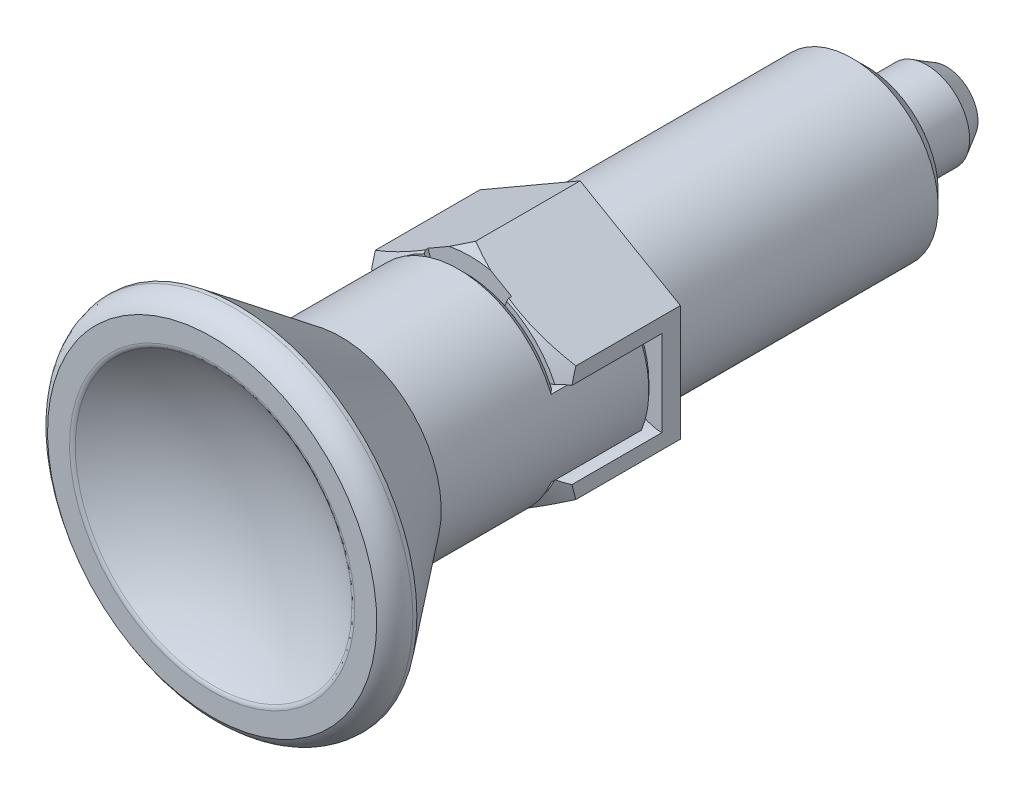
ISO-10303-21;
HEADER;
FILE_DESCRIPTION(('STEP AP214'),'2;1');
FILE_NAME('part.step','',(''),(''),'','','');
FILE_SCHEMA(('AUTOMOTIVE_DESIGN { 1 0 10303 214 1 1 1 1 }'));
ENDSEC;
DATA;
#1=APPLICATION_CONTEXT('core data for automotive mechanical design processes');
#2=APPLICATION_PROTOCOL_DEFINITION('international standard','automotive_design',2000,#1);
#3=PRODUCT_CONTEXT('',#1,'mechanical');
#4=PRODUCT('Part','Part','',(#3));
#5=PRODUCT_RELATED_PRODUCT_CATEGORY('part','',(#4));
#6=PRODUCT_DEFINITION_FORMATION('','',#4);
#7=PRODUCT_DEFINITION_CONTEXT('part definition',#1,'design');
#8=PRODUCT_DEFINITION('design','',#6,#7);
#9=PRODUCT_DEFINITION_SHAPE('','',#8);
#10=(LENGTH_UNIT() NAMED_UNIT(*) SI_UNIT(.MILLI.,.METRE.));
#11=(NAMED_UNIT(*) PLANE_ANGLE_UNIT() SI_UNIT($,.RADIAN.));
#12=(NAMED_UNIT(*) SI_UNIT($,.STERADIAN.) SOLID_ANGLE_UNIT());
#13=UNCERTAINTY_MEASURE_WITH_UNIT(LENGTH_MEASURE(1.E-05),#10,'distance_accuracy_value','');
#14=(GEOMETRIC_REPRESENTATION_CONTEXT(3) GLOBAL_UNCERTAINTY_ASSIGNED_CONTEXT((#13)) GLOBAL_UNIT_ASSIGNED_CONTEXT((#10,
#11,#12)) REPRESENTATION_CONTEXT('',''));
#15=CARTESIAN_POINT('',(0.,0.,0.));
#16=DIRECTION('',(0.,0.,1.));
#17=DIRECTION('',(1.,0.,0.));
#18=AXIS2_PLACEMENT_3D('',#15,#16,#17);
#19=CARTESIAN_POINT('',(4.48447441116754,4.48447441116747,-20.));
#20=DIRECTION('',(0.,0.,-1.));
#21=DIRECTION('',(0.,-1.,0.));
#22=AXIS2_PLACEMENT_3D('',#19,#20,#21);
#23=PLANE('',#22);
#24=CARTESIAN_POINT('',(1.93373684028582E-13,0.,-20.));
#25=DIRECTION('',(0.,0.,-1.));
#26=DIRECTION('',(0.,-1.,0.));
#27=AXIS2_PLACEMENT_3D('',#24,#25,#26);
#28=CIRCLE('',#27,3.1);
#29=CARTESIAN_POINT('',(2.47862388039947E-13,-3.10000000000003,-20.));
#30=VERTEX_POINT('',#29);
#31=EDGE_CURVE('E25',#30,#30,#28,.T.);
#32=ORIENTED_EDGE('',*,*,#31,.F.);
#33=EDGE_LOOP('',(#32));
#34=FACE_BOUND('',#33,.T.);
#35=CARTESIAN_POINT('',(1.80619687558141E-13,0.,-20.));
#36=DIRECTION('',(0.,0.,-1.));
#37=DIRECTION('',(0.,-1.,0.));
#38=AXIS2_PLACEMENT_3D('',#35,#36,#37);
#39=CIRCLE('',#38,5.);
#40=CARTESIAN_POINT('',(2.67906771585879E-13,-5.00000000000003,-20.));
#41=VERTEX_POINT('',#40);
#42=EDGE_CURVE('E728',#41,#41,#39,.T.);
#43=ORIENTED_EDGE('',*,*,#42,.T.);
#44=EDGE_LOOP('',(#43));
#45=FACE_BOUND('',#44,.T.);
#46=ADVANCED_FACE('F14',(#34,#45),#23,.T.);
#47=CARTESIAN_POINT('',(1.7924154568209E-13,0.,-20.2));
#48=DIRECTION('',(0.,0.,-1.));
#49=DIRECTION('',(-1.,0.,0.));
#50=AXIS2_PLACEMENT_3D('',#47,#48,#49);
#51=TOROIDAL_SURFACE('',#50,3.09999999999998,0.200000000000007);
#52=ORIENTED_EDGE('',*,*,#31,.T.);
#53=EDGE_LOOP('',(#52));
#54=FACE_BOUND('',#53,.T.);
#55=CARTESIAN_POINT('',(1.95681839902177E-13,0.,-20.2));
#56=DIRECTION('',(0.,0.,-1.));
#57=DIRECTION('',(0.,-1.,0.));
#58=AXIS2_PLACEMENT_3D('',#55,#56,#57);
#59=CIRCLE('',#58,2.9);
#60=CARTESIAN_POINT('',(2.46308348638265E-13,-2.90000000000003,-20.2));
#61=VERTEX_POINT('',#60);
#62=EDGE_CURVE('E1211',#61,#61,#59,.T.);
#63=ORIENTED_EDGE('',*,*,#62,.F.);
#64=EDGE_LOOP('',(#63));
#65=FACE_BOUND('',#64,.T.);
#66=ADVANCED_FACE('F1194',(#54,#65),#51,.F.);
#67=CARTESIAN_POINT('',(1.9595994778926E-13,0.,-20.2));
#68=DIRECTION('',(0.,0.,-1.));
#69=DIRECTION('',(0.,-1.,0.));
#70=AXIS2_PLACEMENT_3D('',#67,#68,#69);
#71=CYLINDRICAL_SURFACE('',#70,2.9);
#72=ORIENTED_EDGE('',*,*,#62,.T.);
#73=EDGE_LOOP('',(#72));
#74=FACE_BOUND('',#73,.T.);
#75=CARTESIAN_POINT('',(1.96702509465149E-13,0.,-20.2732050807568));
#76=DIRECTION('',(0.,0.,-1.));
#77=DIRECTION('',(0.,-1.,0.));
#78=AXIS2_PLACEMENT_3D('',#75,#76,#77);
#79=CIRCLE('',#78,2.9);
#80=CARTESIAN_POINT('',(2.47017502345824E-13,-2.90000000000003,-20.2732050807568));
#81=VERTEX_POINT('',#80);
#82=EDGE_CURVE('E1213',#81,#81,#79,.T.);
#83=ORIENTED_EDGE('',*,*,#82,.F.);
#84=EDGE_LOOP('',(#83));
#85=FACE_BOUND('',#84,.T.);
#86=ADVANCED_FACE('F1196',(#74,#85),#71,.T.);
#87=CARTESIAN_POINT('',(1.82932491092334E-13,0.,-20.2732050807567));
#88=DIRECTION('',(0.,0.,-1.));
#89=DIRECTION('',(-1.,0.,0.));
#90=AXIS2_PLACEMENT_3D('',#87,#88,#89);
#91=TOROIDAL_SURFACE('',#90,3.10000000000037,0.200000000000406);
#92=ORIENTED_EDGE('',*,*,#82,.T.);
#93=EDGE_LOOP('',(#92));
#94=FACE_BOUND('',#93,.T.);
#95=CARTESIAN_POINT('',(1.97359715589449E-13,0.,-20.3732050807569));
#96=DIRECTION('',(0.,0.,-1.));
#97=DIRECTION('',(0.,-1.,0.));
#98=AXIS2_PLACEMENT_3D('',#95,#96,#97);
#99=CIRCLE('',#98,2.9267949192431);
#100=CARTESIAN_POINT('',(2.48453994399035E-13,-2.92679491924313,-20.3732050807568));
#101=VERTEX_POINT('',#100);
#102=EDGE_CURVE('E1223',#101,#101,#99,.T.);
#103=ORIENTED_EDGE('',*,*,#102,.F.);
#104=EDGE_LOOP('',(#103));
#105=FACE_BOUND('',#104,.T.);
#106=ADVANCED_FACE('F16',(#94,#105),#91,.F.);
#107=CARTESIAN_POINT('',(1.97706722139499E-13,0.,-20.3732050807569));
#108=DIRECTION('',(0.,0.,-1.));
#109=DIRECTION('',(0.,-1.,0.));
#110=AXIS2_PLACEMENT_3D('',#107,#108,#109);
#111=CONICAL_SURFACE('',#110,2.9267949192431,0.523598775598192);
#112=ORIENTED_EDGE('',*,*,#102,.T.);
#113=EDGE_LOOP('',(#112));
#114=FACE_BOUND('',#113,.T.);
#115=CARTESIAN_POINT('',(1.98588005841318E-13,0.,-20.5));
#116=DIRECTION('',(0.,0.,-1.));
#117=DIRECTION('',(0.,-1.,0.));
#118=AXIS2_PLACEMENT_3D('',#115,#116,#117);
#119=CIRCLE('',#118,3.);
#120=CARTESIAN_POINT('',(2.50960256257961E-13,-3.00000000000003,-20.5));
#121=VERTEX_POINT('',#120);
#122=EDGE_CURVE('E1230',#121,#121,#119,.T.);
#123=ORIENTED_EDGE('',*,*,#122,.F.);
#124=EDGE_LOOP('',(#123));
#125=FACE_BOUND('',#124,.T.);
#126=ADVANCED_FACE('F2086',(#114,#125),#111,.T.);
#127=CARTESIAN_POINT('',(1.98588005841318E-13,0.,-20.5));
#128=DIRECTION('',(0.,0.,-1.));
#129=DIRECTION('',(0.,-1.,0.));
#130=AXIS2_PLACEMENT_3D('',#127,#128,#129);
#131=CYLINDRICAL_SURFACE('',#130,3.);
#132=ORIENTED_EDGE('',*,*,#122,.T.);
#133=EDGE_LOOP('',(#132));
#134=FACE_BOUND('',#133,.T.);
#135=CARTESIAN_POINT('',(2.33853747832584E-13,0.,-24.2));
#136=DIRECTION('',(0.,0.,-1.));
#137=DIRECTION('',(0.,-1.,0.));
#138=AXIS2_PLACEMENT_3D('',#135,#136,#137);
#139=CIRCLE('',#138,3.);
#140=CARTESIAN_POINT('',(2.86802969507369E-13,-3.00000000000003,-24.2));
#141=VERTEX_POINT('',#140);
#142=EDGE_CURVE('E1233',#141,#141,#139,.T.);
#143=ORIENTED_EDGE('',*,*,#142,.F.);
#144=EDGE_LOOP('',(#143));
#145=FACE_BOUND('',#144,.T.);
#146=ADVANCED_FACE('F1189',(#134,#145),#131,.T.);
#147=CARTESIAN_POINT('',(2.46769849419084E-13,0.,-25.5810746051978));
#148=DIRECTION('',(0.,0.,1.));
#149=DIRECTION('',(0.,-1.,0.));
#150=AXIS2_PLACEMENT_3D('',#147,#148,#149);
#151=CONICAL_SURFACE('',#150,2.20263620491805,0.523598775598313);
#152=ORIENTED_EDGE('',*,*,#142,.T.);
#153=EDGE_LOOP('',(#152));
#154=FACE_BOUND('',#153,.T.);
#155=CARTESIAN_POINT('',(2.47600221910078E-13,0.,-25.5810746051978));
#156=DIRECTION('',(0.,0.,-1.));
#157=DIRECTION('',(0.,-1.,0.));
#158=AXIS2_PLACEMENT_3D('',#155,#156,#157);
#159=CIRCLE('',#158,2.20263620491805);
#160=CARTESIAN_POINT('',(2.86261830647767E-13,-2.20263620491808,-25.5810746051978));
#161=VERTEX_POINT('',#160);
#162=EDGE_CURVE('E960',#161,#161,#159,.T.);
#163=ORIENTED_EDGE('',*,*,#162,.F.);
#164=EDGE_LOOP('',(#163));
#165=FACE_BOUND('',#164,.T.);
#166=ADVANCED_FACE('F1181',(#154,#165),#151,.T.);
#167=CARTESIAN_POINT('',(1.9374439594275E-13,0.,-20.));
#168=DIRECTION('',(0.,0.,-1.));
#169=DIRECTION('',(0.,-1.,0.));
#170=AXIS2_PLACEMENT_3D('',#167,#168,#169);
#171=SPHERICAL_SURFACE('',#170,5.99999999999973);
#172=ORIENTED_EDGE('',*,*,#162,.T.);
#173=EDGE_LOOP('',(#172));
#174=FACE_BOUND('',#173,.T.);
#175=ADVANCED_FACE('F1179',(#174),#171,.T.);
#176=CARTESIAN_POINT('',(-3.04207695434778E-13,-0.0239314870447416,38.3138625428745));
#177=DIRECTION('',(1.,0.,0.));
#178=DIRECTION('',(0.,-1.,0.));
#179=AXIS2_PLACEMENT_3D('',#176,#177,#178);
#180=CIRCLE('',#179,15.9514082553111);
#181=TRIMMED_CURVE('',#180,(PARAMETER_VALUE(-1.57229660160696)),
(PARAMETER_VALUE(1.57229660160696)),.T.,.PARAMETER.);
#182=CARTESIAN_POINT('',(-3.06424451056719E-13,0.,38.3138625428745));
#183=DIRECTION('',(0.,0.,-1.));
#184=AXIS1_PLACEMENT('',#182,#183);
#185=SURFACE_OF_REVOLUTION('',#181,#184);
#186=CARTESIAN_POINT('',(-1.49255963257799E-13,0.,22.3624722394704));
#187=VERTEX_POINT('',#186);
#188=VERTEX_LOOP('',#187);
#189=FACE_BOUND('',#188,.T.);
#190=CARTESIAN_POINT('',(0.,-9.65593324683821,25.5986830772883));
#191=CARTESIAN_POINT('',(-16.7245669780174,-9.65593324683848,25.5986830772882));
#192=CARTESIAN_POINT('',(-8.36228348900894,4.82796662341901,25.5986830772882));
#193=CARTESIAN_POINT('',(-5.12122140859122E-13,19.3118664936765,25.5986830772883));
#194=CARTESIAN_POINT('',(8.36228348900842,4.82796662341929,25.5986830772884));
#195=CARTESIAN_POINT('',(16.7245669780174,-9.65593324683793,25.5986830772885));
#196=CARTESIAN_POINT('',(0.,-9.65593324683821,25.5986830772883));
#197=(BOUNDED_CURVE() B_SPLINE_CURVE(2,(#190,#191,#192,#193,#194,#195,#196),.UNSPECIFIED.,.T.,
.F.) B_SPLINE_CURVE_WITH_KNOTS((3,2,2,3),(0.,101.250235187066,202.500470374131,
303.750705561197),
.UNSPECIFIED.) CURVE() GEOMETRIC_REPRESENTATION_ITEM() RATIONAL_B_SPLINE_CURVE((0.999999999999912,
0.499999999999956,0.999999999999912,0.499999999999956,0.999999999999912,0.499999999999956,0.999999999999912)) REPRESENTATION_ITEM(''));
#198=CARTESIAN_POINT('',(0.,-9.65593324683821,25.5986830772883));
#199=VERTEX_POINT('',#198);
#200=EDGE_CURVE('E1093',#199,#199,#197,.F.);
#201=ORIENTED_EDGE('',*,*,#200,.T.);
#202=EDGE_LOOP('',(#201));
#203=FACE_BOUND('',#202,.T.);
#204=ADVANCED_FACE('F1013',(#189,#203),#185,.F.);
#205=CARTESIAN_POINT('',(0.,-9.655933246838,25.5986830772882));
#206=CARTESIAN_POINT('',(0.,-9.79006385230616,25.6992172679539));
#207=CARTESIAN_POINT('',(0.,-9.95768116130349,25.7));
#208=CARTESIAN_POINT('',(-16.724566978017,-9.65593324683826,25.598683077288));
#209=CARTESIAN_POINT('',(-16.9568880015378,-9.79006385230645,25.6992172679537));
#210=CARTESIAN_POINT('',(-17.2472096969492,-9.9576811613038,25.7));
#211=CARTESIAN_POINT('',(-8.36228348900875,4.8279666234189,25.5986830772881));
#212=CARTESIAN_POINT('',(-8.47844400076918,4.89503192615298,25.6992172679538));
#213=CARTESIAN_POINT('',(-8.62360484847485,4.97884058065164,25.7));
#214=CARTESIAN_POINT('',(-5.12122140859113E-13,19.3118664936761,25.5986830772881));
#215=CARTESIAN_POINT('',(-5.17689655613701E-13,19.5801277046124,25.6992172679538));
#216=CARTESIAN_POINT('',(-5.2343768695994E-13,19.915362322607,25.7000000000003));
#217=CARTESIAN_POINT('',(8.36228348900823,4.82796662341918,25.5986830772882));
#218=CARTESIAN_POINT('',(8.47844400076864,4.89503192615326,25.6992172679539));
#219=CARTESIAN_POINT('',(8.6236048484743,4.97884058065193,25.7000000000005));
#220=CARTESIAN_POINT('',(16.724566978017,-9.65593324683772,25.5986830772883));
#221=CARTESIAN_POINT('',(16.9568880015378,-9.79006385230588,25.699217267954));
#222=CARTESIAN_POINT('',(17.2472096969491,-9.95768116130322,25.7000000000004));
#223=CARTESIAN_POINT('',(0.,-9.655933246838,25.5986830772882));
#224=CARTESIAN_POINT('',(0.,-9.79006385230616,25.6992172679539));
#225=CARTESIAN_POINT('',(0.,-9.95768116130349,25.7));
#226=(BOUNDED_SURFACE() B_SPLINE_SURFACE(2,2,((#205,#206,#207),(#208,#209,#210),(#211,#212,
#213),(#214,#215,#216),(#217,#218,#219),(#220,#221,#222),(#223,#224,#225)),.UNSPECIFIED.,.T.,
.F.,.F.) B_SPLINE_SURFACE_WITH_KNOTS((3,2,2,3),(3,3),(0.,101.250235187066,202.500470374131,
303.750705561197),(0.,1.),
.UNSPECIFIED.) GEOMETRIC_REPRESENTATION_ITEM() RATIONAL_B_SPLINE_SURFACE(((1.,0.948140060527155,
1.),(0.5,0.474070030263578,0.5),(1.,0.948140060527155,1.),(0.5,0.474070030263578,0.5),(1.,
0.948140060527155,1.),(0.5,0.474070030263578,0.5),(1.,0.948140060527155,1.))) REPRESENTATION_ITEM('') SURFACE());
#227=CARTESIAN_POINT('',(-1.89181121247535E-13,0.,25.7));
#228=DIRECTION('',(0.,0.,1.));
#229=DIRECTION('',(0.,-1.,0.));
#230=AXIS2_PLACEMENT_3D('',#227,#228,#229);
#231=CIRCLE('',#230,9.95768116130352);
#232=CARTESIAN_POINT('',(0.,-9.95768116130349,25.7));
#233=VERTEX_POINT('',#232);
#234=EDGE_CURVE('E1089',#233,#233,#231,.T.);
#235=ORIENTED_EDGE('',*,*,#200,.F.);
#236=EDGE_LOOP('',(#235));
#237=FACE_BOUND('',#236,.T.);
#238=ORIENTED_EDGE('',*,*,#234,.T.);
#239=EDGE_LOOP('',(#238));
#240=FACE_BOUND('',#239,.T.);
#241=ADVANCED_FACE('F1111',(#237,#240),#226,.T.);
#242=CARTESIAN_POINT('',(-12.6474492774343,12.6474492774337,25.7));
#243=DIRECTION('',(0.,0.,1.));
#244=DIRECTION('',(0.,-1.,0.));
#245=AXIS2_PLACEMENT_3D('',#242,#243,#244);
#246=PLANE('',#245);
#247=CARTESIAN_POINT('',(-1.94294771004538E-13,0.,25.7000000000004));
#248=DIRECTION('',(0.,0.,1.));
#249=DIRECTION('',(0.,-1.,0.));
#250=AXIS2_PLACEMENT_3D('',#247,#248,#249);
#251=CIRCLE('',#250,11.4976811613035);
#252=CARTESIAN_POINT('',(0.,-11.4976811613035,25.7000000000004));
#253=VERTEX_POINT('',#252);
#254=EDGE_CURVE('E1085',#253,#253,#251,.T.);
#255=ORIENTED_EDGE('',*,*,#254,.T.);
#256=EDGE_LOOP('',(#255));
#257=FACE_BOUND('',#256,.T.);
#258=ORIENTED_EDGE('',*,*,#234,.F.);
#259=EDGE_LOOP('',(#258));
#260=FACE_BOUND('',#259,.T.);
#261=ADVANCED_FACE('F1122',(#257,#260),#246,.T.);
#262=CARTESIAN_POINT('',(0.,-11.4976811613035,25.7000000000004));
#263=CARTESIAN_POINT('',(0.,-12.3893988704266,25.1975433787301));
#264=CARTESIAN_POINT('',(0.,-12.5,24.1800000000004));
#265=CARTESIAN_POINT('',(-19.9145679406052,-11.4976811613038,25.7));
#266=CARTESIAN_POINT('',(-21.4590683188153,-12.3893988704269,25.19754337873));
#267=CARTESIAN_POINT('',(-21.650635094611,-12.5000000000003,24.18));
#268=CARTESIAN_POINT('',(-9.95728397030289,5.74884058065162,25.7));
#269=CARTESIAN_POINT('',(-10.7295341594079,6.19469943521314,25.19754337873));
#270=CARTESIAN_POINT('',(-10.8253175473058,6.24999999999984,24.18));
#271=CARTESIAN_POINT('',(-5.76258947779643E-13,22.995362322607,25.7000000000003));
#272=CARTESIAN_POINT('',(-6.01936740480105E-13,24.7787977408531,25.1975433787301));
#273=CARTESIAN_POINT('',(-5.95868142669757E-13,25.,24.1800000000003));
#274=CARTESIAN_POINT('',(9.95728397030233,5.74884058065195,25.7000000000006));
#275=CARTESIAN_POINT('',(10.7295341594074,6.1946994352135,25.1975433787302));
#276=CARTESIAN_POINT('',(10.8253175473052,6.25000000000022,24.1800000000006));
#277=CARTESIAN_POINT('',(19.9145679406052,-11.4976811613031,25.7000000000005));
#278=CARTESIAN_POINT('',(21.4590683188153,-12.3893988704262,25.1975433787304));
#279=CARTESIAN_POINT('',(21.6506350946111,-12.4999999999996,24.1800000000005));
#280=CARTESIAN_POINT('',(0.,-11.4976811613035,25.7000000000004));
#281=CARTESIAN_POINT('',(0.,-12.3893988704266,25.1975433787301));
#282=CARTESIAN_POINT('',(0.,-12.5,24.1800000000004));
#283=(BOUNDED_SURFACE() B_SPLINE_SURFACE(2,2,((#262,#263,#264),(#265,#266,#267),(#268,#269,
#270),(#271,#272,#273),(#274,#275,#276),(#277,#278,#279),(#280,#281,#282)),.UNSPECIFIED.,.T.,
.F.,.F.) B_SPLINE_SURFACE_WITH_KNOTS((3,2,2,3),(3,3),(0.,20.6159773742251,41.2319547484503,
61.8479321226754),(0.,1.),
.UNSPECIFIED.) GEOMETRIC_REPRESENTATION_ITEM() RATIONAL_B_SPLINE_SURFACE(((1.,0.890197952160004,
1.),(0.5,0.445098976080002,0.5),(1.,0.890197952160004,1.),(0.5,0.445098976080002,0.5),(1.,
0.890197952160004,1.),(0.5,0.445098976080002,0.5),(1.,0.890197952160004,1.))) REPRESENTATION_ITEM('') SURFACE());
#284=CARTESIAN_POINT('',(-1.76630788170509E-13,0.,24.1800000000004));
#285=DIRECTION('',(0.,0.,1.));
#286=DIRECTION('',(0.,-1.,0.));
#287=AXIS2_PLACEMENT_3D('',#284,#285,#286);
#288=CIRCLE('',#287,12.5);
#289=CARTESIAN_POINT('',(0.,-12.5,24.1800000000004));
#290=VERTEX_POINT('',#289);
#291=EDGE_CURVE('E1077',#290,#290,#288,.T.);
#292=CARTESIAN_POINT('',(0.,-11.4976811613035,25.7000000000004));
#293=CARTESIAN_POINT('',(0.,-11.5018190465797,25.6976684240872));
#294=CARTESIAN_POINT('',(0.,-11.5059486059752,25.6953220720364));
#295=CARTESIAN_POINT('',(0.,-11.51419774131,25.6905959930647));
#296=CARTESIAN_POINT('',(0.,-11.5183172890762,25.6882162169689));
#297=CARTESIAN_POINT('',(0.,-11.526546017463,25.6834233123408));
#298=CARTESIAN_POINT('',(0.,-11.5306551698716,25.6810101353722));
#299=CARTESIAN_POINT('',(0.,-11.5388627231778,25.6761504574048));
#300=CARTESIAN_POINT('',(0.,-11.5429610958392,25.6737039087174));
#301=CARTESIAN_POINT('',(0.,-11.5511467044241,25.6687775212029));
#302=CARTESIAN_POINT('',(0.,-11.5552339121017,25.6662976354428));
#303=CARTESIAN_POINT('',(0.,-11.5633968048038,25.6613046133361));
#304=CARTESIAN_POINT('',(0.,-11.5674724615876,25.6587914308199));
#305=CARTESIAN_POINT('',(0.,-11.5756118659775,25.6537318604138));
#306=CARTESIAN_POINT('',(0.,-11.579675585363,25.6511854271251));
#307=CARTESIAN_POINT('',(0.,-11.5877907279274,25.6460594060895));
#308=CARTESIAN_POINT('',(0.,-11.5918421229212,25.6434797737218));
#309=CARTESIAN_POINT('',(0.,-11.5999322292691,25.6382874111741));
#310=CARTESIAN_POINT('',(0.,-11.6039709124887,25.6356746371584));
#311=CARTESIAN_POINT('',(0.,-11.6120352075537,25.630416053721));
#312=CARTESIAN_POINT('',(0.,-11.6160607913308,25.6277702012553));
#313=CARTESIAN_POINT('',(0.,-11.624098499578,25.6224455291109));
#314=CARTESIAN_POINT('',(0.,-11.6281105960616,25.619766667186));
#315=CARTESIAN_POINT('',(0.,-11.6361209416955,25.6143760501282));
#316=CARTESIAN_POINT('',(0.,-11.6401191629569,25.6116642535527));
#317=CARTESIAN_POINT('',(0.,-11.6481013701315,25.606207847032));
#318=CARTESIAN_POINT('',(0.,-11.6520853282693,25.6034631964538));
#319=CARTESIAN_POINT('',(0.,-11.6600386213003,25.5979411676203));
#320=CARTESIAN_POINT('',(0.,-11.6640079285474,25.5951637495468));
#321=CARTESIAN_POINT('',(0.,-11.6719315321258,25.5895762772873));
#322=CARTESIAN_POINT('',(0.,-11.6758858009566,25.5867661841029));
#323=CARTESIAN_POINT('',(0.,-11.6837789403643,25.5811134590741));
#324=CARTESIAN_POINT('',(0.,-11.6877177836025,25.5782707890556));
#325=CARTESIAN_POINT('',(0.,-11.695579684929,25.5725530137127));
#326=CARTESIAN_POINT('',(0.,-11.6995027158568,25.5696778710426));
#327=CARTESIAN_POINT('',(0.,-11.707332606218,25.5638952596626));
#328=CARTESIAN_POINT('',(0.,-11.7112394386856,25.5609877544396));
#329=CARTESIAN_POINT('',(0.,-11.7190365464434,25.5551405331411));
#330=CARTESIAN_POINT('',(0.,-11.7229267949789,25.5522007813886));
#331=CARTESIAN_POINT('',(0.,-11.7306903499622,25.5462891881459));
#332=CARTESIAN_POINT('',(0.,-11.7345636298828,25.5433173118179));
#333=CARTESIAN_POINT('',(0.,-11.7422928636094,25.5373415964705));
#334=CARTESIAN_POINT('',(0.,-11.7461487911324,25.5343377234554));
#335=CARTESIAN_POINT('',(0.,-11.7538429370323,25.5282981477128));
#336=CARTESIAN_POINT('',(0.,-11.757681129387,25.5252624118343));
#337=CARTESIAN_POINT('',(0.,-11.765339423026,25.519159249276));
#338=CARTESIAN_POINT('',(0.,-11.7691594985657,25.5160917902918));
#339=CARTESIAN_POINT('',(0.,-11.7767811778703,25.5099253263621));
#340=CARTESIAN_POINT('',(0.,-11.780582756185,25.5068262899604));
#341=CARTESIAN_POINT('',(0.,-11.7881670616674,25.5005968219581));
#342=CARTESIAN_POINT('',(0.,-11.7919497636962,25.497466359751));
#343=CARTESIAN_POINT('',(0.,-11.7994959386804,25.4911741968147));
#344=CARTESIAN_POINT('',(0.,-11.8032593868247,25.4880124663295));
#345=CARTESIAN_POINT('',(0.,-11.810766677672,25.4816579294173));
#346=CARTESIAN_POINT('',(0.,-11.8145104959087,25.4784650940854));
#347=CARTESIAN_POINT('',(0.,-11.8219781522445,25.4720485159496));
#348=CARTESIAN_POINT('',(0.,-11.8257019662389,25.4688247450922));
#349=CARTESIAN_POINT('',(0.,-11.8331292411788,25.4623464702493));
#350=CARTESIAN_POINT('',(0.,-11.8368326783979,25.4590919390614));
#351=CARTESIAN_POINT('',(0.,-11.8442188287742,25.4525523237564));
#352=CARTESIAN_POINT('',(0.,-11.8479015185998,25.4492672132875));
#353=CARTESIAN_POINT('',(0.,-11.8552458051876,25.4426666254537));
#354=CARTESIAN_POINT('',(0.,-11.8589073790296,25.4393511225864));
#355=CARTESIAN_POINT('',(0.,-11.8662090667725,25.4326899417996));
#356=CARTESIAN_POINT('',(0.,-11.8698491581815,25.4293442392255));
#357=CARTESIAN_POINT('',(0.,-11.8771075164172,25.4226228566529));
#358=CARTESIAN_POINT('',(0.,-11.8807257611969,25.4192471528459));
#359=CARTESIAN_POINT('',(0.,-11.8879400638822,25.4124659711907));
#360=CARTESIAN_POINT('',(0.,-11.891536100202,25.4090604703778));
#361=CARTESIAN_POINT('',(0.,-11.8987056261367,25.4022199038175));
#362=CARTESIAN_POINT('',(0.,-11.9022790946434,25.3987848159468));
#363=CARTESIAN_POINT('',(0.,-11.9094031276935,25.3918852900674));
#364=CARTESIAN_POINT('',(0.,-11.9129536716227,25.3884208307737));
#365=CARTESIAN_POINT('',(0.,-11.9200315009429,25.381462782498));
#366=CARTESIAN_POINT('',(0.,-11.92355876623,25.3779691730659));
#367=CARTESIAN_POINT('',(0.,-11.930589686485,25.3709530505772));
#368=CARTESIAN_POINT('',(0.,-11.9340933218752,25.3674305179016));
#369=CARTESIAN_POINT('',(0.,-11.9410766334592,25.3603567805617));
#370=CARTESIAN_POINT('',(0.,-11.9445562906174,25.3568055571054));
#371=CARTESIAN_POINT('',(0.,-11.951491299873,25.3496746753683));
#372=CARTESIAN_POINT('',(0.,-11.9549466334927,25.3460949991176));
#373=CARTESIAN_POINT('',(0.,-11.9618326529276,25.3389074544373));
#374=CARTESIAN_POINT('',(0.,-11.9652633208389,25.3352995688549));
#375=CARTESIAN_POINT('',(0.,-11.9720996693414,25.3280558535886));
#376=CARTESIAN_POINT('',(0.,-11.975505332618,25.3244200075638));
#377=CARTESIAN_POINT('',(0.,-11.9822913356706,25.3171206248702));
#378=CARTESIAN_POINT('',(0.,-11.9856716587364,25.3134570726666));
#379=CARTESIAN_POINT('',(0.,-11.992406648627,25.3061025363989));
#380=CARTESIAN_POINT('',(0.,-11.9957612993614,25.3024115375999));
#381=CARTESIAN_POINT('',(0.,-12.0024446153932,25.2950023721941));
#382=CARTESIAN_POINT('',(0.,-12.0057732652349,25.2912841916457));
#383=CARTESIAN_POINT('',(0.,-12.0124042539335,25.2838209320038));
#384=CARTESIAN_POINT('',(0.,-12.015706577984,25.2800758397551));
#385=CARTESIAN_POINT('',(0.,-12.0222845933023,25.2725590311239));
#386=CARTESIAN_POINT('',(0.,-12.0255602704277,25.2687873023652));
#387=CARTESIAN_POINT('',(0.,-12.0320846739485,25.2612175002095));
#388=CARTESIAN_POINT('',(0.,-12.0353333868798,25.2574194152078));
#389=CARTESIAN_POINT('',(0.,-12.0418035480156,25.2497971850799));
#390=CARTESIAN_POINT('',(0.,-12.0450249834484,25.2459730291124));
#391=CARTESIAN_POINT('',(0.,-12.0514402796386,25.2382989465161));
#392=CARTESIAN_POINT('',(0.,-12.0546341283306,25.234449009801));
#393=CARTESIAN_POINT('',(0.,-12.0609939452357,25.2267236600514));
#394=CARTESIAN_POINT('',(0.,-12.0641599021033,25.2228482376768));
#395=CARTESIAN_POINT('',(0.,-12.0704636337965,25.2150722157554));
#396=CARTESIAN_POINT('',(0.,-12.0736013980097,25.2111716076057));
#397=CARTESIAN_POINT('',(0.,-12.0798484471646,25.2033455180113));
#398=CARTESIAN_POINT('',(0.,-12.0829577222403,25.1994200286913));
#399=CARTESIAN_POINT('',(0.,-12.0891475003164,25.1915444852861));
#400=CARTESIAN_POINT('',(0.,-12.09222799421,25.1875944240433));
#401=CARTESIAN_POINT('',(0.,-12.0983599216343,25.1796700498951));
#402=CARTESIAN_POINT('',(0.,-12.1014113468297,25.1756957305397));
#403=CARTESIAN_POINT('',(0.,-12.1074848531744,25.1677231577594));
#404=CARTESIAN_POINT('',(0.,-12.1105069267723,25.1637248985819));
#405=CARTESIAN_POINT('',(0.,-12.1165214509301,25.1557047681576));
#406=CARTESIAN_POINT('',(0.,-12.1195138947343,25.1516828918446));
#407=CARTESIAN_POINT('',(0.,-12.125468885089,25.143615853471));
#408=CARTESIAN_POINT('',(0.,-12.128431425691,25.1395706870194));
#409=CARTESIAN_POINT('',(0.,-12.1343263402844,25.1314573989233));
#410=CARTESIAN_POINT('',(0.,-12.1372587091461,25.1273892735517));
#411=CARTESIAN_POINT('',(0.,-12.143093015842,25.1192304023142));
#412=CARTESIAN_POINT('',(0.,-12.1459949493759,25.1151396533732));
#413=CARTESIAN_POINT('',(0.,-12.1517681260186,25.1069358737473));
#414=CARTESIAN_POINT('',(0.,-12.1546393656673,25.1028228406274));
#415=CARTESIAN_POINT('',(0.,-12.1603509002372,25.0945748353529));
#416=CARTESIAN_POINT('',(0.,-12.1631911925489,25.090439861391));
#417=CARTESIAN_POINT('',(0.,-12.1688405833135,25.082148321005));
#418=CARTESIAN_POINT('',(0.,-12.1716496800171,25.0779917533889));
#419=CARTESIAN_POINT('',(0.,-12.1772364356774,25.0696573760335));
#420=CARTESIAN_POINT('',(0.,-12.1800140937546,25.0654795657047));
#421=CARTESIAN_POINT('',(0.,-12.1855377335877,25.0571030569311));
#422=CARTESIAN_POINT('',(0.,-12.188283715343,25.052904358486));
#423=CARTESIAN_POINT('',(0.,-12.1937437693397,25.0444864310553));
#424=CARTESIAN_POINT('',(0.,-12.1964578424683,25.0402672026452));
#425=CARTESIAN_POINT('',(0.,-12.2018538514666,25.0318085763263));
#426=CARTESIAN_POINT('',(0.,-12.2045357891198,25.0275691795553));
#427=CARTESIAN_POINT('',(0.,-12.2098673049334,25.0190705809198));
#428=CARTESIAN_POINT('',(0.,-12.2125168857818,25.0148113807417));
#429=CARTESIAN_POINT('',(0.,-12.2177834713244,25.0062735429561));
#430=CARTESIAN_POINT('',(0.,-12.2204004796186,25.0019949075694));
#431=CARTESIAN_POINT('',(0.,-12.2256017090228,24.9934185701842));
#432=CARTESIAN_POINT('',(0.,-12.2281859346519,24.9891208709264));
#433=CARTESIAN_POINT('',(0.,-12.2333213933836,24.9805067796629));
#434=CARTESIAN_POINT('',(0.,-12.2358726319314,24.9761903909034));
#435=CARTESIAN_POINT('',(0.,-12.2409419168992,24.967539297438));
#436=CARTESIAN_POINT('',(0.,-12.2434599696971,24.9632045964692));
#437=CARTESIAN_POINT('',(0.,-12.2484626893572,24.9545172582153));
#438=CARTESIAN_POINT('',(0.,-12.2509473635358,24.9501646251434));
#439=CARTESIAN_POINT('',(0.,-12.2558831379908,24.9414418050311));
#440=CARTESIAN_POINT('',(0.,-12.2583342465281,24.9370716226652));
#441=CARTESIAN_POINT('',(0.,-12.263202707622,24.9283140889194));
#442=CARTESIAN_POINT('',(0.,-12.2656200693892,24.9239267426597));
#443=CARTESIAN_POINT('',(0.,-12.2704208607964,24.9151352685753));
#444=CARTESIAN_POINT('',(0.,-12.2728043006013,24.9107311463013));
#445=CARTESIAN_POINT('',(0.,-12.2775370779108,24.9019065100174));
#446=CARTESIAN_POINT('',(0.,-12.2798864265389,24.8974860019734));
#447=CARTESIAN_POINT('',(0.,-12.2845508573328,24.8886289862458));
#448=CARTESIAN_POINT('',(0.,-12.286865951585,24.8841924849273));
#449=CARTESIAN_POINT('',(0.,-12.2914617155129,24.875303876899));
#450=CARTESIAN_POINT('',(0.,-12.2937423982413,24.8708517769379));
#451=CARTESIAN_POINT('',(0.,-12.298269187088,24.8619323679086));
#452=CARTESIAN_POINT('',(0.,-12.3005153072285,24.8574650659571));
#453=CARTESIAN_POINT('',(0.,-12.3049728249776,24.8485156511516));
#454=CARTESIAN_POINT('',(0.,-12.3071842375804,24.8440335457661));
#455=CARTESIAN_POINT('',(0.,-12.3115722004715,24.8350549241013));
#456=CARTESIAN_POINT('',(0.,-12.3137487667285,24.8305584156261));
#457=CARTESIAN_POINT('',(0.,-12.3180669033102,24.821551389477));
#458=CARTESIAN_POINT('',(0.,-12.3202084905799,24.8170408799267));
#459=CARTESIAN_POINT('',(0.,-12.3244565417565,24.8080062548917));
#460=CARTESIAN_POINT('',(0.,-12.3265630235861,24.8034821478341));
#461=CARTESIAN_POINT('',(0.,-12.3307407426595,24.7944207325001));
#462=CARTESIAN_POINT('',(0.,-12.3328119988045,24.789883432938));
#463=CARTESIAN_POINT('',(0.,-12.3369191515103,24.7807960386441));
#464=CARTESIAN_POINT('',(0.,-12.3389550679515,24.7762459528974));
#465=CARTESIAN_POINT('',(0.,-12.3429914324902,24.7671333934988));
#466=CARTESIAN_POINT('',(0.,-12.3449919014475,24.7625709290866));
#467=CARTESIAN_POINT('',(0.,-12.3489572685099,24.7534340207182));
#468=CARTESIAN_POINT('',(0.,-12.3509221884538,24.74885958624));
#469=CARTESIAN_POINT('',(0.,-12.3548163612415,24.7396991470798));
#470=CARTESIAN_POINT('',(0.,-12.3567456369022,24.7351131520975));
#471=CARTESIAN_POINT('',(0.,-12.360568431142,24.7259300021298));
#472=CARTESIAN_POINT('',(0.,-12.3624619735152,24.7213328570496));
#473=CARTESIAN_POINT('',(0.,-12.3662132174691,24.712127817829));
#474=CARTESIAN_POINT('',(0.,-12.3680709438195,24.7075199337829));
#475=CARTESIAN_POINT('',(0.,-12.3717504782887,24.698293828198));
#476=CARTESIAN_POINT('',(0.,-12.3735723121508,24.6936756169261));
#477=CARTESIAN_POINT('',(0.,-12.3771799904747,24.6844292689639));
#478=CARTESIAN_POINT('',(0.,-12.378965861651,24.6798011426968));
#479=CARTESIAN_POINT('',(0.,-12.3825015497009,24.6705353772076));
#480=CARTESIAN_POINT('',(0.,-12.3842513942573,24.6658977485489));
#481=CARTESIAN_POINT('',(0.,-12.3877149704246,24.6566133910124));
#482=CARTESIAN_POINT('',(0.,-12.3894287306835,24.6519666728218));
#483=CARTESIAN_POINT('',(0.,-12.3928200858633,24.642664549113));
#484=CARTESIAN_POINT('',(0.,-12.3944977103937,24.6380091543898));
#485=CARTESIAN_POINT('',(0.,-12.3978167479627,24.6286900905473));
#486=CARTESIAN_POINT('',(0.,-12.399458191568,24.6240264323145));
#487=CARTESIAN_POINT('',(0.,-12.4027048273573,24.6146912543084));
#488=CARTESIAN_POINT('',(0.,-12.4043100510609,24.6100197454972));
#489=CARTESIAN_POINT('',(0.,-12.4074842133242,24.6006692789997));
#490=CARTESIAN_POINT('',(0.,-12.4090531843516,24.5959903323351));
#491=CARTESIAN_POINT('',(0.,-12.4121548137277,24.5866254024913));
#492=CARTESIAN_POINT('',(0.,-12.413687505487,24.5819394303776));
#493=CARTESIAN_POINT('',(0.,-12.4167165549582,24.5725608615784));
#494=CARTESIAN_POINT('',(0.,-12.4182129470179,24.5678682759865));
#495=CARTESIAN_POINT('',(0.,-12.4211693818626,24.5584768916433));
#496=CARTESIAN_POINT('',(0.,-12.4226294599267,24.553778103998));
#497=CARTESIAN_POINT('',(0.,-12.4255132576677,24.5443747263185));
#498=CARTESIAN_POINT('',(0.,-12.4269370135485,24.5396701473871));
#499=CARTESIAN_POINT('',(0.,-12.4297481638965,24.5302555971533));
#500=CARTESIAN_POINT('',(0.,-12.4311355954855,24.5255456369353));
#501=CARTESIAN_POINT('',(0.,-12.4338741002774,24.5161207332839));
#502=CARTESIAN_POINT('',(0.,-12.4352252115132,24.5114058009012));
#503=CARTESIAN_POINT('',(0.,-12.4378910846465,24.5019713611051));
#504=CARTESIAN_POINT('',(0.,-12.4392058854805,24.4972518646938));
#505=CARTESIAN_POINT('',(0.,-12.4417991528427,24.4878087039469));
#506=CARTESIAN_POINT('',(0.,-12.443077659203,24.4830850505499));
#507=CARTESIAN_POINT('',(0.,-12.4455983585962,24.4736339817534));
#508=CARTESIAN_POINT('',(0.,-12.4468405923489,24.4689065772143));
#509=CARTESIAN_POINT('',(0.,-12.4492887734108,24.4594484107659));
#510=CARTESIAN_POINT('',(0.,-12.450494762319,24.4547176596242));
#511=CARTESIAN_POINT('',(0.,-12.4528704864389,24.4452532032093));
#512=CARTESIAN_POINT('',(0.,-12.4540402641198,24.4405195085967));
#513=CARTESIAN_POINT('',(0.,-12.4563436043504,24.431049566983));
#514=CARTESIAN_POINT('',(0.,-12.4574772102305,24.4263133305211));
#515=CARTESIAN_POINT('',(0.,-12.4597082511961,24.4168387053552));
#516=CARTESIAN_POINT('',(0.,-12.4608057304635,24.4121003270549));
#517=CARTESIAN_POINT('',(0.,-12.4629645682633,24.4026218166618));
#518=CARTESIAN_POINT('',(0.,-12.4640259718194,24.3978816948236));
#519=CARTESIAN_POINT('',(0.,-12.4661127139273,24.3884000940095));
#520=CARTESIAN_POINT('',(0.,-12.4671380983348,24.3836586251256));
#521=CARTESIAN_POINT('',(0.,-12.4691528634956,24.3741747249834));
#522=CARTESIAN_POINT('',(0.,-12.470142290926,24.3694323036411));
#523=CARTESIAN_POINT('',(0.,-12.4720852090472,24.3599468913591));
#524=CARTESIAN_POINT('',(0.,-12.4730387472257,24.3552039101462));
#525=CARTESIAN_POINT('',(0.,-12.4749099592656,24.3457177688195));
#526=CARTESIAN_POINT('',(0.,-12.4758276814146,24.3409746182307));
#527=CARTESIAN_POINT('',(0.,-12.4776273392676,24.3314885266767));
#528=CARTESIAN_POINT('',(0.,-12.4785093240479,24.326745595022));
#529=CARTESIAN_POINT('',(0.,-12.4802375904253,24.3172603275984));
#530=CARTESIAN_POINT('',(0.,-12.4810839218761,24.312518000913));
#531=CARTESIAN_POINT('',(0.,-12.4827409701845,24.3030343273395));
#532=CARTESIAN_POINT('',(0.,-12.4835517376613,24.2982929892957));
#533=CARTESIAN_POINT('',(0.,-12.4851377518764,24.2888116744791));
#534=CARTESIAN_POINT('',(0.,-12.4859130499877,24.2840717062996));
#535=CARTESIAN_POINT('',(0.,-12.4874282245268,24.2745935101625));
#536=CARTESIAN_POINT('',(0.,-12.488168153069,24.2698552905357));
#537=CARTESIAN_POINT('',(0.,-12.4896126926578,24.2603809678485));
#538=CARTESIAN_POINT('',(0.,-12.4903173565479,24.2556448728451));
#539=CARTESIAN_POINT('',(0.,-12.4916914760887,24.2461751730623));
#540=CARTESIAN_POINT('',(0.,-12.4923609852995,24.2414415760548));
#541=CARTESIAN_POINT('',(0.,-12.4936649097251,24.2319772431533));
#542=CARTESIAN_POINT('',(0.,-12.4942993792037,24.2272465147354));
#543=CARTESIAN_POINT('',(0.,-12.4955333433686,24.217788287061));
#544=CARTESIAN_POINT('',(0.,-12.4961328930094,24.2130607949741));
#545=CARTESIAN_POINT('',(0.,-12.4972971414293,24.2036094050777));
#546=CARTESIAN_POINT('',(0.,-12.4978618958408,24.1988855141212));
#547=CARTESIAN_POINT('',(0.,-12.4989566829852,24.1894416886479));
#548=CARTESIAN_POINT('',(0.,-12.4994867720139,24.1847217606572));
#549=CARTESIAN_POINT('',(0.,-12.5,24.1800000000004));
#550=B_SPLINE_CURVE_WITH_KNOTS('',3,(#292,#293,#294,#295,#296,#297,#298,#299,#300,#301,#302,
#303,#304,#305,#306,#307,#308,#309,#310,#311,#312,#313,#314,#315,#316,#317,#318,#319,#320,#321,
#322,#323,#324,#325,#326,#327,#328,#329,#330,#331,#332,#333,#334,#335,#336,#337,#338,#339,#340,
#341,#342,#343,#344,#345,#346,#347,#348,#349,#350,#351,#352,#353,#354,#355,#356,#357,#358,#359,
#360,#361,#362,#363,#364,#365,#366,#367,#368,#369,#370,#371,#372,#373,#374,#375,#376,#377,#378,
#379,#380,#381,#382,#383,#384,#385,#386,#387,#388,#389,#390,#391,#392,#393,#394,#395,#396,#397,
#398,#399,#400,#401,#402,#403,#404,#405,#406,#407,#408,#409,#410,#411,#412,#413,#414,#415,#416,
#417,#418,#419,#420,#421,#422,#423,#424,#425,#426,#427,#428,#429,#430,#431,#432,#433,#434,#435,
#436,#437,#438,#439,#440,#441,#442,#443,#444,#445,#446,#447,#448,#449,#450,#451,#452,#453,#454,
#455,#456,#457,#458,#459,#460,#461,#462,#463,#464,#465,#466,#467,#468,#469,#470,#471,#472,#473,
#474,#475,#476,#477,#478,#479,#480,#481,#482,#483,#484,#485,#486,#487,#488,#489,#490,#491,#492,
#493,#494,#495,#496,#497,#498,#499,#500,#501,#502,#503,#504,#505,#506,#507,#508,#509,#510,#511,
#512,#513,#514,#515,#516,#517,#518,#519,#520,#521,#522,#523,#524,#525,#526,#527,#528,#529,#530,
#531,#532,#533,#534,#535,#536,#537,#538,#539,#540,#541,#542,#543,#544,#545,#546,#547,#548,#549),
.UNSPECIFIED.,.F.,.F.,(4,2,2,2,2,2,2,2,2,2,2,2,2,2,2,2,2,2,2,2,2,2,2,2,2,2,2,2,2,2,2,2,2,2,2,2,
2,2,2,2,2,2,2,2,2,2,2,2,2,2,2,2,2,2,2,2,2,2,2,2,2,2,2,2,2,2,2,2,2,2,2,2,2,2,2,2,2,2,2,2,2,2,2,2,
2,2,2,2,2,2,2,2,2,2,2,2,2,2,2,2,2,2,2,2,2,2,2,2,2,2,2,2,2,2,2,2,2,2,2,2,2,2,2,2,2,2,2,2,4),(0.,
0.0142486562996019,0.0285210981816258,0.0428170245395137,0.0571361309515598,0.0714781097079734,
0.0858426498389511,0.100229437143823,0.114638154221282,0.129068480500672,0.143520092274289,
0.157992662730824,0.172485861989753,0.18699935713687,0.201532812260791,0.216085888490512,
0.230658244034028,0.245249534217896,0.259859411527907,0.274487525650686,0.289133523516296,
0.303797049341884,0.318477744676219,0.333175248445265,0.347889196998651,0.36261922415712,
0.377364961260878,0.392126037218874,0.406902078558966,0.421692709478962,0.436497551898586,
0.451316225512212,0.466148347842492,0.480993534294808,0.49585139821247,0.51072155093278,
0.525603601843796,0.540497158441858,0.555401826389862,0.570317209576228,0.58524291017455,
0.600178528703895,0.615123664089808,0.630077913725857,0.645040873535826,0.660012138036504,
0.674991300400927,0.689977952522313,0.704971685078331,0.719972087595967,0.734978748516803,
0.74999125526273,0.765009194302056,0.780032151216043,0.795059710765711,0.810091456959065,
0.825126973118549,0.840165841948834,0.85520764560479,0.870251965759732,0.885298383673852,
0.900346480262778,0.915395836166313,0.930446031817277,0.945496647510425,0.960547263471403,
0.975597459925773,0.990646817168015,1.00569491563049,1.02074133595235,1.03578565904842,
1.05082746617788,1.06586633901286,1.08090185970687,1.09593361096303,1.11096117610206,
1.12598413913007,1.14100208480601,1.15601459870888,1.17102126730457,1.18602167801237,
1.20101541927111,1.21600208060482,1.2309812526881,1.24595252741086,1.26091549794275,
1.27586975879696,1.29081490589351,1.30575053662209,1.32067624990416,1.33559164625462,
1.35049632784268,1.36538989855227,1.38027196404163,1.39514213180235,1.41000001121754,
1.42484521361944,1.43967735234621,1.45449604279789,1.4693009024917,1.48409155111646,
1.49886761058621,1.51362870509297,1.52837446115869,1.5431045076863,1.55781847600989,
1.57251599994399,1.58719671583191,1.60186026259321,1.61650628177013,1.63113441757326,
1.64574431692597,1.66033562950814,1.67490800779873,1.68946110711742,1.7039945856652,
1.71850810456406,1.73300132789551,1.74747392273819,1.76192555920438,1.7763559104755,
1.79076465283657,1.80515146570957,1.81951603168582,1.83385803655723,1.84817716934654,
1.86247312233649,1.87674559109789,1.89099427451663),.UNSPECIFIED.);
#551=EDGE_CURVE('BSEAM1130',#253,#290,#550,.T.);
#552=ORIENTED_EDGE('',*,*,#254,.F.);
#553=ORIENTED_EDGE('',*,*,#291,.T.);
#554=ORIENTED_EDGE('',*,*,#551,.T.);
#555=ORIENTED_EDGE('',*,*,#551,.F.);
#556=EDGE_LOOP('',(#552,#554,#553,#555));
#557=FACE_BOUND('',#556,.T.);
#558=ADVANCED_FACE('F1130',(#557),#283,.T.);
#559=CARTESIAN_POINT('',(-1.69020678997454E-13,0.,24.1800000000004));
#560=DIRECTION('',(0.,0.,-1.));
#561=DIRECTION('',(0.,-1.,0.));
#562=AXIS2_PLACEMENT_3D('',#559,#560,#561);
#563=CYLINDRICAL_SURFACE('',#562,12.5);
#564=ORIENTED_EDGE('',*,*,#291,.F.);
#565=EDGE_LOOP('',(#564));
#566=FACE_BOUND('',#565,.T.);
#567=CARTESIAN_POINT('',(-1.77775715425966E-13,0.,23.9000000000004));
#568=DIRECTION('',(0.,0.,1.));
#569=DIRECTION('',(0.,-1.,0.));
#570=AXIS2_PLACEMENT_3D('',#567,#568,#569);
#571=CIRCLE('',#570,12.5);
#572=CARTESIAN_POINT('',(0.,-12.5,23.9000000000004));
#573=VERTEX_POINT('',#572);
#574=EDGE_CURVE('E1069',#573,#573,#571,.T.);
#575=ORIENTED_EDGE('',*,*,#574,.T.);
#576=EDGE_LOOP('',(#575));
#577=FACE_BOUND('',#576,.T.);
#578=ADVANCED_FACE('F1136',(#566,#577),#563,.T.);
#579=CARTESIAN_POINT('',(9.34999999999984,9.35000000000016,0.));
#580=DIRECTION('',(0.,0.,-1.));
#581=DIRECTION('',(0.,-1.,0.));
#582=AXIS2_PLACEMENT_3D('',#579,#580,#581);
#583=PLANE('',#582);
#584=DIRECTION('',(0.,1.,0.));
#585=VECTOR('',#584,1.);
#586=CARTESIAN_POINT('',(-7.,-4.04145188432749,0.));
#587=LINE('',#586,#585);
#588=CARTESIAN_POINT('',(-7.,-4.04145188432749,0.));
#589=VERTEX_POINT('',#588);
#590=CARTESIAN_POINT('',(-7.,4.04145188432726,0.));
#591=VERTEX_POINT('',#590);
#592=EDGE_CURVE('E494',#589,#591,#587,.T.);
#593=ORIENTED_EDGE('',*,*,#592,.T.);
#594=DIRECTION('',(0.86602540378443,0.500000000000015,0.));
#595=VECTOR('',#594,1.);
#596=CARTESIAN_POINT('',(-7.,4.04145188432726,0.));
#597=LINE('',#596,#595);
#598=CARTESIAN_POINT('',(-1.52148300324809E-13,8.08290376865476,0.));
#599=VERTEX_POINT('',#598);
#600=EDGE_CURVE('E498',#591,#599,#597,.T.);
#601=ORIENTED_EDGE('',*,*,#600,.T.);
#602=DIRECTION('',(0.866025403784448,-0.499999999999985,0.));
#603=VECTOR('',#602,1.);
#604=CARTESIAN_POINT('',(-1.52148300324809E-13,8.08290376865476,0.));
#605=LINE('',#604,#603);
#606=CARTESIAN_POINT('',(7.,4.0414518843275,0.));
#607=VERTEX_POINT('',#606);
#608=EDGE_CURVE('E623',#599,#607,#605,.T.);
#609=ORIENTED_EDGE('',*,*,#608,.T.);
#610=DIRECTION('',(0.,-1.,0.));
#611=VECTOR('',#610,1.);
#612=CARTESIAN_POINT('',(7.,4.0414518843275,0.));
#613=LINE('',#612,#611);
#614=CARTESIAN_POINT('',(7.,-4.04145188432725,0.));
#615=VERTEX_POINT('',#614);
#616=EDGE_CURVE('E620',#607,#615,#613,.T.);
#617=ORIENTED_EDGE('',*,*,#616,.T.);
#618=DIRECTION('',(-0.86602540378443,-0.500000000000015,0.));
#619=VECTOR('',#618,1.);
#620=CARTESIAN_POINT('',(7.,-4.04145188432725,0.));
#621=LINE('',#620,#619);
#622=CARTESIAN_POINT('',(1.19916366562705E-13,-8.08290376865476,0.));
#623=VERTEX_POINT('',#622);
#624=EDGE_CURVE('E527',#615,#623,#621,.T.);
#625=ORIENTED_EDGE('',*,*,#624,.T.);
#626=DIRECTION('',(-0.866025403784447,0.499999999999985,0.));
#627=VECTOR('',#626,1.);
#628=CARTESIAN_POINT('',(1.19916366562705E-13,-8.08290376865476,0.));
#629=LINE('',#628,#627);
#630=EDGE_CURVE('E520',#623,#589,#629,.T.);
#631=ORIENTED_EDGE('',*,*,#630,.T.);
#632=EDGE_LOOP('',(#593,#601,#609,#617,#625,#631));
#633=FACE_BOUND('',#632,.T.);
#634=CARTESIAN_POINT('',(0.,0.,0.));
#635=DIRECTION('',(0.,0.,1.));
#636=DIRECTION('',(0.,-1.,0.));
#637=AXIS2_PLACEMENT_3D('',#634,#635,#636);
#638=CIRCLE('',#637,6.);
#639=CARTESIAN_POINT('',(0.,-6.,0.));
#640=VERTEX_POINT('',#639);
#641=EDGE_CURVE('E528',#640,#640,#638,.T.);
#642=ORIENTED_EDGE('',*,*,#641,.T.);
#643=EDGE_LOOP('',(#642));
#644=FACE_BOUND('',#643,.T.);
#645=ADVANCED_FACE('F1145',(#633,#644),#583,.T.);
#646=CARTESIAN_POINT('',(0.,0.,16.7));
#647=DIRECTION('',(0.,0.,1.));
#648=DIRECTION('',(0.,-1.,0.));
#649=AXIS2_PLACEMENT_3D('',#646,#647,#648);
#650=CONICAL_SURFACE('',#649,7.,0.652330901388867);
#651=ORIENTED_EDGE('',*,*,#574,.F.);
#652=EDGE_LOOP('',(#651));
#653=FACE_BOUND('',#652,.T.);
#654=CARTESIAN_POINT('',(-1.00708631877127E-13,0.,16.7));
#655=DIRECTION('',(0.,0.,1.));
#656=DIRECTION('',(0.,-1.,0.));
#657=AXIS2_PLACEMENT_3D('',#654,#655,#656);
#658=CIRCLE('',#657,7.);
#659=CARTESIAN_POINT('',(0.,-6.99999999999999,16.7));
#660=VERTEX_POINT('',#659);
#661=EDGE_CURVE('E1062',#660,#660,#658,.T.);
#662=ORIENTED_EDGE('',*,*,#661,.T.);
#663=EDGE_LOOP('',(#662));
#664=FACE_BOUND('',#663,.T.);
#665=ADVANCED_FACE('F1147',(#653,#664),#650,.T.);
#666=CARTESIAN_POINT('',(-7.00000000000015,4.04145188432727,8.));
#667=DIRECTION('',(1.,0.,0.));
#668=DIRECTION('',(0.,-1.,0.));
#669=AXIS2_PLACEMENT_3D('',#666,#667,#668);
#670=PLANE('',#669);
#671=DIRECTION('',(0.,-1.,0.));
#672=VECTOR('',#671,1.);
#673=CARTESIAN_POINT('',(-7.,2.99833287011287,1.29999999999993));
#674=LINE('',#673,#672);
#675=CARTESIAN_POINT('',(-7.,2.99833287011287,1.29999999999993));
#676=VERTEX_POINT('',#675);
#677=CARTESIAN_POINT('',(-7.,-2.99833287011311,1.29999999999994));
#678=VERTEX_POINT('',#677);
#679=EDGE_CURVE('E485',#676,#678,#674,.T.);
#680=ORIENTED_EDGE('',*,*,#679,.F.);
#681=DIRECTION('',(0.,0.,-1.));
#682=VECTOR('',#681,1.);
#683=CARTESIAN_POINT('',(-7.00000000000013,2.99833287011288,7.57007707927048));
#684=LINE('',#683,#682);
#685=CARTESIAN_POINT('',(-7.00000000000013,2.99833287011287,7.57007707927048));
#686=VERTEX_POINT('',#685);
#687=EDGE_CURVE('E792',#686,#676,#684,.T.);
#688=ORIENTED_EDGE('',*,*,#687,.F.);
#689=CARTESIAN_POINT('',(-7.00000000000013,2.99833287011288,7.57007707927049));
#690=CARTESIAN_POINT('',(-7.00000000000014,3.5043503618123,7.45504785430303));
#691=CARTESIAN_POINT('',(-7.00000000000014,4.04145188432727,7.3));
#692=(BOUNDED_CURVE() B_SPLINE_CURVE(2,(#689,#690,#691),.UNSPECIFIED.,.F.,
.F.) B_SPLINE_CURVE_WITH_KNOTS((3,3),(0.,0.117179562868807),
.UNSPECIFIED.) CURVE() GEOMETRIC_REPRESENTATION_ITEM() RATIONAL_B_SPLINE_CURVE((1.03200708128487,
1.01812774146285,1.)) REPRESENTATION_ITEM(''));
#693=CARTESIAN_POINT('',(-7.00000000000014,4.04145188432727,7.3));
#694=VERTEX_POINT('',#693);
#695=EDGE_CURVE('E488',#686,#694,#692,.T.);
#696=ORIENTED_EDGE('',*,*,#695,.T.);
#697=DIRECTION('',(0.,0.,-1.));
#698=VECTOR('',#697,1.);
#699=CARTESIAN_POINT('',(-7.00000000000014,4.04145188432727,7.3));
#700=LINE('',#699,#698);
#701=EDGE_CURVE('E489',#694,#591,#700,.T.);
#702=ORIENTED_EDGE('',*,*,#701,.T.);
#703=ORIENTED_EDGE('',*,*,#592,.F.);
#704=DIRECTION('',(0.,0.,1.));
#705=VECTOR('',#704,1.);
#706=CARTESIAN_POINT('',(-7.,-4.04145188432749,0.));
#707=LINE('',#706,#705);
#708=CARTESIAN_POINT('',(-7.,-4.04145188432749,7.3));
#709=VERTEX_POINT('',#708);
#710=EDGE_CURVE('E493',#589,#709,#707,.T.);
#711=ORIENTED_EDGE('',*,*,#710,.T.);
#712=CARTESIAN_POINT('',(-7.,-4.04145188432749,7.3));
#713=CARTESIAN_POINT('',(-7.00000000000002,-3.50435036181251,7.45504785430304));
#714=CARTESIAN_POINT('',(-7.00000000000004,-2.9983328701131,7.57007707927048));
#715=(BOUNDED_CURVE() B_SPLINE_CURVE(2,(#712,#713,#714),.UNSPECIFIED.,.F.,
.F.) B_SPLINE_CURVE_WITH_KNOTS((3,3),(0.882820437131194,1.),
.UNSPECIFIED.) CURVE() GEOMETRIC_REPRESENTATION_ITEM() RATIONAL_B_SPLINE_CURVE((1.,
1.01812774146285,1.03200708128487)) REPRESENTATION_ITEM(''));
#716=CARTESIAN_POINT('',(-7.,-2.9983328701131,7.57007707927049));
#717=VERTEX_POINT('',#716);
#718=EDGE_CURVE('E502',#709,#717,#715,.T.);
#719=ORIENTED_EDGE('',*,*,#718,.T.);
#720=DIRECTION('',(0.,0.,1.));
#721=VECTOR('',#720,1.);
#722=CARTESIAN_POINT('',(-7.,-2.99833287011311,1.29999999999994));
#723=LINE('',#722,#721);
#724=EDGE_CURVE('E784',#678,#717,#723,.T.);
#725=ORIENTED_EDGE('',*,*,#724,.F.);
#726=EDGE_LOOP('',(#680,#688,#696,#702,#703,#711,#719,#725));
#727=FACE_BOUND('',#726,.T.);
#728=ADVANCED_FACE('F760',(#727),#670,.F.);
#729=CARTESIAN_POINT('',(0.,0.,8.5));
#730=DIRECTION('',(0.,0.,-1.));
#731=DIRECTION('',(0.,-1.,0.));
#732=AXIS2_PLACEMENT_3D('',#729,#730,#731);
#733=CONICAL_SURFACE('',#732,6.00444279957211,1.0471975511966);
#734=CARTESIAN_POINT('',(1.44817154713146,7.24680153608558,7.70000000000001));
#735=CARTESIAN_POINT('',(0.756507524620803,7.64613394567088,7.55216917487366));
#736=CARTESIAN_POINT('',(-2.22865004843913E-13,8.08290376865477,7.3));
#737=(BOUNDED_CURVE() B_SPLINE_CURVE(2,(#734,#735,#736),.UNSPECIFIED.,.F.,
.F.) B_SPLINE_CURVE_WITH_KNOTS((3,3),(0.80723073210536,1.),
.UNSPECIFIED.) CURVE() GEOMETRIC_REPRESENTATION_ITEM() RATIONAL_B_SPLINE_CURVE((1.04814567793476,
1.02982150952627,1.)) REPRESENTATION_ITEM(''));
#738=CARTESIAN_POINT('',(1.44817154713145,7.24680153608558,7.7));
#739=VERTEX_POINT('',#738);
#740=CARTESIAN_POINT('',(-2.2629176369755E-13,8.08290376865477,7.3));
#741=VERTEX_POINT('',#740);
#742=EDGE_CURVE('E661',#739,#741,#737,.T.);
#743=ORIENTED_EDGE('',*,*,#742,.T.);
#744=CARTESIAN_POINT('',(-2.22865004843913E-13,8.08290376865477,7.3));
#745=CARTESIAN_POINT('',(-0.756507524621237,7.64613394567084,7.55216917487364));
#746=CARTESIAN_POINT('',(-1.44817154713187,7.24680153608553,7.69999999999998));
#747=(BOUNDED_CURVE() B_SPLINE_CURVE(2,(#744,#745,#746),.UNSPECIFIED.,.F.,
.F.) B_SPLINE_CURVE_WITH_KNOTS((3,3),(0.,0.19276926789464),
.UNSPECIFIED.) CURVE() GEOMETRIC_REPRESENTATION_ITEM() RATIONAL_B_SPLINE_CURVE((1.,
1.02982150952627,1.04814567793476)) REPRESENTATION_ITEM(''));
#748=CARTESIAN_POINT('',(-1.44817154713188,7.24680153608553,7.7));
#749=VERTEX_POINT('',#748);
#750=EDGE_CURVE('E656',#741,#749,#747,.T.);
#751=ORIENTED_EDGE('',*,*,#750,.T.);
#752=CARTESIAN_POINT('',(0.,0.,7.7));
#753=DIRECTION('',(0.,0.,-1.));
#754=DIRECTION('',(-0.195961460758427,0.980611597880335,0.));
#755=AXIS2_PLACEMENT_3D('',#752,#753,#754);
#756=CIRCLE('',#755,7.39008344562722);
#757=EDGE_CURVE('E662',#749,#739,#756,.T.);
#758=ORIENTED_EDGE('',*,*,#757,.T.);
#759=EDGE_LOOP('',(#743,#751,#758));
#760=FACE_BOUND('',#759,.T.);
#761=ADVANCED_FACE('F1924',(#760),#733,.T.);
#762=CARTESIAN_POINT('',(-7.24037558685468,7.24037558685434,8.));
#763=DIRECTION('',(0.,0.,1.));
#764=DIRECTION('',(0.,-1.,0.));
#765=AXIS2_PLACEMENT_3D('',#762,#763,#764);
#766=PLANE('',#765);
#767=CARTESIAN_POINT('',(0.,0.,8.));
#768=DIRECTION('',(0.,0.,1.));
#769=DIRECTION('',(0.,1.,0.));
#770=AXIS2_PLACEMENT_3D('',#767,#768,#769);
#771=CIRCLE('',#770,6.5);
#772=CARTESIAN_POINT('',(-2.74584174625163,5.89154929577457,8.));
#773=VERTEX_POINT('',#772);
#774=CARTESIAN_POINT('',(-5.89154929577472,2.74584174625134,8.));
#775=VERTEX_POINT('',#774);
#776=EDGE_CURVE('E1248',#773,#775,#771,.T.);
#777=ORIENTED_EDGE('',*,*,#776,.F.);
#778=CARTESIAN_POINT('',(-2.15377795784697E-13,7.1,8.));
#779=DIRECTION('',(0.,0.,-1.));
#780=DIRECTION('',(0.,-1.,0.));
#781=AXIS2_PLACEMENT_3D('',#778,#779,#780);
#782=CIRCLE('',#781,3.);
#783=CARTESIAN_POINT('',(-2.87420351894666,6.24037558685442,8.));
#784=VERTEX_POINT('',#783);
#785=EDGE_CURVE('E685',#773,#784,#782,.T.);
#786=ORIENTED_EDGE('',*,*,#785,.T.);
#787=CARTESIAN_POINT('',(0.,0.,8.));
#788=DIRECTION('',(0.,0.,1.));
#789=DIRECTION('',(-0.418341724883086,0.908289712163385,0.));
#790=AXIS2_PLACEMENT_3D('',#787,#788,#789);
#791=CIRCLE('',#790,6.87046820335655);
#792=CARTESIAN_POINT('',(-6.24037558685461,2.87420351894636,8.));
#793=VERTEX_POINT('',#792);
#794=EDGE_CURVE('E689',#784,#793,#791,.T.);
#795=ORIENTED_EDGE('',*,*,#794,.T.);
#796=CARTESIAN_POINT('',(-7.10000000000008,-1.15214214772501E-13,8.));
#797=DIRECTION('',(0.,0.,-1.));
#798=DIRECTION('',(0.286541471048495,0.958067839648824,0.));
#799=AXIS2_PLACEMENT_3D('',#796,#797,#798);
#800=CIRCLE('',#799,3.);
#801=EDGE_CURVE('E1265',#793,#775,#800,.T.);
#802=ORIENTED_EDGE('',*,*,#801,.T.);
#803=EDGE_LOOP('',(#777,#786,#795,#802));
#804=FACE_BOUND('',#803,.T.);
#805=ADVANCED_FACE('F1958',(#804),#766,.T.);
#806=ORIENTED_EDGE('',*,*,#794,.F.);
#807=CARTESIAN_POINT('',(-2.87420351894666,6.24037558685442,8.));
#808=CARTESIAN_POINT('',(-2.88987050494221,6.29275905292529,7.96874599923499));
#809=CARTESIAN_POINT('',(-2.9040925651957,6.3455151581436,7.93763737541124));
#810=CARTESIAN_POINT('',(-2.91690844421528,6.39882589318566,7.90656290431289));
#811=B_SPLINE_CURVE_WITH_KNOTS('',3,(#807,#808,#809,#810),.UNSPECIFIED.,.F.,.F.,(4,4),(0.,
0.308534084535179),.UNSPECIFIED.);
#812=CARTESIAN_POINT('',(-2.91690844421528,6.39882589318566,7.90656290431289));
#813=VERTEX_POINT('',#812);
#814=EDGE_CURVE('E676',#784,#813,#811,.T.);
#815=ORIENTED_EDGE('',*,*,#814,.T.);
#816=CARTESIAN_POINT('',(-2.91690844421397,6.39882589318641,7.9065629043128));
#817=CARTESIAN_POINT('',(-4.81655454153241,5.30206470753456,8.02781515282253));
#818=CARTESIAN_POINT('',(-7.00000000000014,4.04145188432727,7.3));
#819=(BOUNDED_CURVE() B_SPLINE_CURVE(2,(#816,#817,#818),.UNSPECIFIED.,.F.,
.F.) B_SPLINE_CURVE_WITH_KNOTS((3,3),(0.410464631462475,1.),
.UNSPECIFIED.) CURVE() GEOMETRIC_REPRESENTATION_ITEM() RATIONAL_B_SPLINE_CURVE((1.0748699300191,
1.09120143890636,1.)) REPRESENTATION_ITEM(''));
#820=EDGE_CURVE('E670',#813,#694,#819,.T.);
#821=ORIENTED_EDGE('',*,*,#820,.T.);
#822=ORIENTED_EDGE('',*,*,#695,.F.);
#823=CARTESIAN_POINT('',(-6.2403755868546,2.87420351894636,8.00000000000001));
#824=CARTESIAN_POINT('',(-6.27462384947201,2.88444675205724,7.97956644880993));
#825=CARTESIAN_POINT('',(-6.30907865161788,2.89408451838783,7.9591753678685));
#826=CARTESIAN_POINT('',(-6.37731393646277,2.91186017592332,7.91910360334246));
#827=CARTESIAN_POINT('',(-6.41108324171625,2.92003464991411,7.89942010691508));
#828=CARTESIAN_POINT('',(-6.47788001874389,2.9349789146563,7.86076339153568));
#829=CARTESIAN_POINT('',(-6.51089773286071,2.94178459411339,7.84178718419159));
#830=CARTESIAN_POINT('',(-6.57613141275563,2.95408659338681,7.80454531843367));
#831=CARTESIAN_POINT('',(-6.60833893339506,2.95961803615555,7.78627646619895));
#832=CARTESIAN_POINT('',(-6.67189948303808,2.96946619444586,7.75044949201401));
#833=CARTESIAN_POINT('',(-6.70324527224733,2.97381721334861,7.73288795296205));
#834=CARTESIAN_POINT('',(-6.76503639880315,2.98139810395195,7.69847588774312));
#835=CARTESIAN_POINT('',(-6.79547559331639,2.98466141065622,7.68162169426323));
#836=CARTESIAN_POINT('',(-6.85541384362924,2.99015898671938,7.64862442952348));
#837=CARTESIAN_POINT('',(-6.88490774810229,2.992425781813,7.63247741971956));
#838=CARTESIAN_POINT('',(-6.94292187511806,2.99602062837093,7.60089534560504));
#839=CARTESIAN_POINT('',(-6.9714378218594,2.99738026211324,7.58545601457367));
#840=CARTESIAN_POINT('',(-7.00000000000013,2.99833287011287,7.57007707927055));
#841=B_SPLINE_CURVE_WITH_KNOTS('',3,(#823,#824,#825,#826,#827,#828,#829,#830,#831,#832,#833,
#834,#835,#836,#837,#838,#839,#840),.UNSPECIFIED.,.F.,.F.,(4,2,2,2,2,2,2,2,4),(0.,
0.123520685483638,0.243300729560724,0.359340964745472,0.471642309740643,0.58020578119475,
0.6850325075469,0.786123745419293,0.883480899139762),.UNSPECIFIED.);
#842=EDGE_CURVE('E742',#793,#686,#841,.T.);
#843=ORIENTED_EDGE('',*,*,#842,.F.);
#844=EDGE_LOOP('',(#806,#815,#821,#822,#843));
#845=FACE_BOUND('',#844,.T.);
#846=ADVANCED_FACE('F1294',(#845),#733,.T.);
#847=CARTESIAN_POINT('',(-2.2964605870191E-13,8.08290376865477,8.));
#848=DIRECTION('',(0.500000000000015,-0.86602540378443,0.));
#849=DIRECTION('',(-0.86602540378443,-0.500000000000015,0.));
#850=AXIS2_PLACEMENT_3D('',#847,#848,#849);
#851=PLANE('',#850);
#852=DIRECTION('',(0.86602540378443,0.500000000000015,0.));
#853=VECTOR('',#852,1.);
#854=CARTESIAN_POINT('',(-2.91690844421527,6.39882589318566,7.7));
#855=LINE('',#854,#853);
#856=CARTESIAN_POINT('',(-2.91690844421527,6.39882589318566,7.7));
#857=VERTEX_POINT('',#856);
#858=EDGE_CURVE('E651',#857,#749,#855,.T.);
#859=ORIENTED_EDGE('',*,*,#858,.T.);
#860=ORIENTED_EDGE('',*,*,#750,.F.);
#861=DIRECTION('',(0.,0.,-1.));
#862=VECTOR('',#861,1.);
#863=CARTESIAN_POINT('',(-2.11823324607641E-13,8.08290376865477,7.3));
#864=LINE('',#863,#862);
#865=EDGE_CURVE('E655',#741,#599,#864,.T.);
#866=ORIENTED_EDGE('',*,*,#865,.T.);
#867=ORIENTED_EDGE('',*,*,#600,.F.);
#868=ORIENTED_EDGE('',*,*,#701,.F.);
#869=ORIENTED_EDGE('',*,*,#820,.F.);
#870=DIRECTION('',(0.,0.,-1.));
#871=VECTOR('',#870,1.);
#872=CARTESIAN_POINT('',(-2.91690844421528,6.39882589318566,7.90656290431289));
#873=LINE('',#872,#871);
#874=EDGE_CURVE('E669',#813,#857,#873,.T.);
#875=ORIENTED_EDGE('',*,*,#874,.T.);
#876=EDGE_LOOP('',(#859,#860,#866,#867,#868,#869,#875));
#877=FACE_BOUND('',#876,.T.);
#878=ADVANCED_FACE('F1298',(#877),#851,.F.);
#879=CARTESIAN_POINT('',(6.99999999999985,4.04145188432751,8.));
#880=DIRECTION('',(-0.499999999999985,-0.866025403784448,0.));
#881=DIRECTION('',(-0.866025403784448,0.499999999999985,0.));
#882=AXIS2_PLACEMENT_3D('',#879,#880,#881);
#883=PLANE('',#882);
#884=CARTESIAN_POINT('',(6.99999999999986,4.04145188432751,7.3));
#885=CARTESIAN_POINT('',(4.81655454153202,5.30206470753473,8.02781515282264));
#886=CARTESIAN_POINT('',(2.91690844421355,6.39882589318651,7.90656290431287));
#887=(BOUNDED_CURVE() B_SPLINE_CURVE(2,(#884,#885,#886),.UNSPECIFIED.,.F.,
.F.) B_SPLINE_CURVE_WITH_KNOTS((3,3),(0.,0.589535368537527),
.UNSPECIFIED.) CURVE() GEOMETRIC_REPRESENTATION_ITEM() RATIONAL_B_SPLINE_CURVE((1.,
1.09120143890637,1.0748699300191)) REPRESENTATION_ITEM(''));
#888=CARTESIAN_POINT('',(6.99999999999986,4.04145188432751,7.3));
#889=VERTEX_POINT('',#888);
#890=CARTESIAN_POINT('',(2.91690844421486,6.39882589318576,7.90656290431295));
#891=VERTEX_POINT('',#890);
#892=EDGE_CURVE('E591',#889,#891,#887,.T.);
#893=ORIENTED_EDGE('',*,*,#892,.F.);
#894=DIRECTION('',(0.,0.,1.));
#895=VECTOR('',#894,1.);
#896=CARTESIAN_POINT('',(7.,4.0414518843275,0.));
#897=LINE('',#896,#895);
#898=EDGE_CURVE('E619',#607,#889,#897,.T.);
#899=ORIENTED_EDGE('',*,*,#898,.F.);
#900=ORIENTED_EDGE('',*,*,#608,.F.);
#901=ORIENTED_EDGE('',*,*,#865,.F.);
#902=ORIENTED_EDGE('',*,*,#742,.F.);
#903=DIRECTION('',(0.866025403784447,-0.499999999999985,0.));
#904=VECTOR('',#903,1.);
#905=CARTESIAN_POINT('',(1.44817154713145,7.24680153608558,7.7));
#906=LINE('',#905,#904);
#907=CARTESIAN_POINT('',(2.91690844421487,6.39882589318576,7.7));
#908=VERTEX_POINT('',#907);
#909=EDGE_CURVE('E700',#739,#908,#906,.T.);
#910=ORIENTED_EDGE('',*,*,#909,.T.);
#911=DIRECTION('',(0.,0.,1.));
#912=VECTOR('',#911,1.);
#913=CARTESIAN_POINT('',(2.91690844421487,6.39882589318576,7.7));
#914=LINE('',#913,#912);
#915=EDGE_CURVE('E696',#908,#891,#914,.T.);
#916=ORIENTED_EDGE('',*,*,#915,.T.);
#917=EDGE_LOOP('',(#893,#899,#900,#901,#902,#910,#916));
#918=FACE_BOUND('',#917,.T.);
#919=ADVANCED_FACE('F1985',(#918),#883,.F.);
#920=CARTESIAN_POINT('',(5.89154929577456,2.74584174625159,8.));
#921=VERTEX_POINT('',#920);
#922=CARTESIAN_POINT('',(2.74584174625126,5.89154929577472,8.));
#923=VERTEX_POINT('',#922);
#924=EDGE_CURVE('E1254',#921,#923,#771,.T.);
#925=ORIENTED_EDGE('',*,*,#924,.F.);
#926=CARTESIAN_POINT('',(7.09999999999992,1.383189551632E-13,8.));
#927=DIRECTION('',(0.,0.,-1.));
#928=DIRECTION('',(-0.286541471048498,-0.958067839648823,0.));
#929=AXIS2_PLACEMENT_3D('',#926,#927,#928);
#930=CIRCLE('',#929,3.);
#931=CARTESIAN_POINT('',(6.24037558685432,2.87420351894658,8.));
#932=VERTEX_POINT('',#931);
#933=EDGE_CURVE('E880',#921,#932,#930,.T.);
#934=ORIENTED_EDGE('',*,*,#933,.T.);
#935=CARTESIAN_POINT('',(-1.9285686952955E-13,0.,7.99999999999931));
#936=DIRECTION('',(-1.01013772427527E-13,0.,1.));
#937=DIRECTION('',(0.908289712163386,0.418341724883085,1.0796220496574E-13));
#938=AXIS2_PLACEMENT_3D('',#935,#936,#937);
#939=CIRCLE('',#938,6.87046820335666);
#940=CARTESIAN_POINT('',(2.87420351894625,6.24037558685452,8.));
#941=VERTEX_POINT('',#940);
#942=EDGE_CURVE('E694',#932,#941,#939,.T.);
#943=ORIENTED_EDGE('',*,*,#942,.T.);
#944=CARTESIAN_POINT('',(-2.18358971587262E-13,7.1,8.));
#945=DIRECTION('',(0.,0.,-1.));
#946=DIRECTION('',(0.958067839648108,-0.286541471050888,0.));
#947=AXIS2_PLACEMENT_3D('',#944,#945,#946);
#948=CIRCLE('',#947,3.);
#949=EDGE_CURVE('E690',#941,#923,#948,.T.);
#950=ORIENTED_EDGE('',*,*,#949,.T.);
#951=EDGE_LOOP('',(#925,#934,#943,#950));
#952=FACE_BOUND('',#951,.T.);
#953=ADVANCED_FACE('F1916',(#952),#766,.T.);
#954=CARTESIAN_POINT('',(6.99999999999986,4.04145188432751,7.3));
#955=CARTESIAN_POINT('',(6.99999999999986,3.50435036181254,7.45504785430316));
#956=CARTESIAN_POINT('',(6.99999999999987,2.99833287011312,7.5700770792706));
#957=(BOUNDED_CURVE() B_SPLINE_CURVE(2,(#954,#955,#956),.UNSPECIFIED.,.F.,
.F.) B_SPLINE_CURVE_WITH_KNOTS((3,3),(0.882820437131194,1.),
.UNSPECIFIED.) CURVE() GEOMETRIC_REPRESENTATION_ITEM() RATIONAL_B_SPLINE_CURVE((1.,
1.01812774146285,1.03200708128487)) REPRESENTATION_ITEM(''));
#958=CARTESIAN_POINT('',(6.99999999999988,2.99833287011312,7.57007707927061));
#959=VERTEX_POINT('',#958);
#960=EDGE_CURVE('E589',#889,#959,#957,.T.);
#961=ORIENTED_EDGE('',*,*,#960,.F.);
#962=ORIENTED_EDGE('',*,*,#892,.T.);
#963=CARTESIAN_POINT('',(2.91690844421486,6.39882589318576,7.90656290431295));
#964=CARTESIAN_POINT('',(2.9040940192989,6.34552057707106,7.93763417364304));
#965=CARTESIAN_POINT('',(2.8898677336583,6.29274978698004,7.96875152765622));
#966=CARTESIAN_POINT('',(2.87420351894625,6.24037558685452,8.));
#967=B_SPLINE_CURVE_WITH_KNOTS('',3,(#963,#964,#965,#966),.UNSPECIFIED.,.F.,.F.,(4,4),
(0.691365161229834,1.),.UNSPECIFIED.);
#968=EDGE_CURVE('E598',#891,#941,#967,.T.);
#969=ORIENTED_EDGE('',*,*,#968,.T.);
#970=ORIENTED_EDGE('',*,*,#942,.F.);
#971=CARTESIAN_POINT('',(6.99999999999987,2.99833287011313,7.57007707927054));
#972=CARTESIAN_POINT('',(6.97143607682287,2.99738020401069,7.58545702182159));
#973=CARTESIAN_POINT('',(6.94291838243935,2.99602046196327,7.60089735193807));
#974=CARTESIAN_POINT('',(6.8849012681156,2.99242532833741,7.63248114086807));
#975=CARTESIAN_POINT('',(6.8554061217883,2.99015836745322,7.64862886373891));
#976=CARTESIAN_POINT('',(6.79546589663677,2.98466042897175,7.68162727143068));
#977=CARTESIAN_POINT('',(6.76502596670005,2.98139693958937,7.69848189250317));
#978=CARTESIAN_POINT('',(6.70323387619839,2.97381569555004,7.73289452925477));
#979=CARTESIAN_POINT('',(6.67188785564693,2.96946452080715,7.75045621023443));
#980=CARTESIAN_POINT('',(6.60832734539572,2.95961610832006,7.78628318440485));
#981=CARTESIAN_POINT('',(6.57612009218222,2.954084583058,7.80455189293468));
#982=CARTESIAN_POINT('',(6.51088744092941,2.9417825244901,7.84179318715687));
#983=CARTESIAN_POINT('',(6.4778704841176,2.93497688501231,7.86076896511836));
#984=CARTESIAN_POINT('',(6.41107570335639,2.92003285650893,7.89942453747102));
#985=CARTESIAN_POINT('',(6.37730763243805,2.91185859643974,7.91910731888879));
#986=CARTESIAN_POINT('',(6.30907528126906,2.89408357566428,7.95917736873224));
#987=CARTESIAN_POINT('',(6.27462217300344,2.88444625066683,7.97956744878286));
#988=CARTESIAN_POINT('',(6.24037558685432,2.87420351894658,7.99999999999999));
#989=B_SPLINE_CURVE_WITH_KNOTS('',3,(#971,#972,#973,#974,#975,#976,#977,#978,#979,#980,#981,
#982,#983,#984,#985,#986,#987,#988),.UNSPECIFIED.,.F.,.F.,(4,2,2,2,2,2,2,2,4),(0.,
0.0973631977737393,0.198458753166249,0.303288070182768,0.411852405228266,0.524152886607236,
0.640190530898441,0.759966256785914,0.883480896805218),.UNSPECIFIED.);
#990=EDGE_CURVE('E597',#959,#932,#989,.T.);
#991=ORIENTED_EDGE('',*,*,#990,.F.);
#992=EDGE_LOOP('',(#961,#962,#969,#970,#991));
#993=FACE_BOUND('',#992,.T.);
#994=ADVANCED_FACE('F1949',(#993),#733,.T.);
#995=CARTESIAN_POINT('',(7.,-4.04145188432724,8.));
#996=DIRECTION('',(-1.,0.,0.));
#997=DIRECTION('',(0.,1.,0.));
#998=AXIS2_PLACEMENT_3D('',#995,#996,#997);
#999=PLANE('',#998);
#1000=DIRECTION('',(0.,1.,0.));
#1001=VECTOR('',#1000,1.);
#1002=CARTESIAN_POINT('',(7.,-2.99833287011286,1.30000000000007));
#1003=LINE('',#1002,#1001);
#1004=CARTESIAN_POINT('',(7.,-2.99833287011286,1.30000000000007));
#1005=VERTEX_POINT('',#1004);
#1006=CARTESIAN_POINT('',(7.,2.99833287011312,1.30000000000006));
#1007=VERTEX_POINT('',#1006);
#1008=EDGE_CURVE('E608',#1005,#1007,#1003,.T.);
#1009=ORIENTED_EDGE('',*,*,#1008,.F.);
#1010=DIRECTION('',(0.,0.,-1.));
#1011=VECTOR('',#1010,1.);
#1012=CARTESIAN_POINT('',(7.,-2.99833287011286,7.57007707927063));
#1013=LINE('',#1012,#1011);
#1014=CARTESIAN_POINT('',(7.,-2.99833287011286,7.57007707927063));
#1015=VERTEX_POINT('',#1014);
#1016=EDGE_CURVE('E865',#1015,#1005,#1013,.T.);
#1017=ORIENTED_EDGE('',*,*,#1016,.F.);
#1018=CARTESIAN_POINT('',(6.99999999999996,-2.99833287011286,7.57007707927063));
#1019=CARTESIAN_POINT('',(6.99999999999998,-3.50435036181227,7.45504785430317));
#1020=CARTESIAN_POINT('',(7.,-4.04145188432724,7.30000000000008));
#1021=(BOUNDED_CURVE() B_SPLINE_CURVE(2,(#1018,#1019,#1020),.UNSPECIFIED.,.F.,
.F.) B_SPLINE_CURVE_WITH_KNOTS((3,3),(0.,0.117179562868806),
.UNSPECIFIED.) CURVE() GEOMETRIC_REPRESENTATION_ITEM() RATIONAL_B_SPLINE_CURVE((1.03200708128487,
1.01812774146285,1.)) REPRESENTATION_ITEM(''));
#1022=CARTESIAN_POINT('',(7.,-4.04145188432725,7.30000000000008));
#1023=VERTEX_POINT('',#1022);
#1024=EDGE_CURVE('E607',#1015,#1023,#1021,.T.);
#1025=ORIENTED_EDGE('',*,*,#1024,.T.);
#1026=DIRECTION('',(0.,0.,-1.));
#1027=VECTOR('',#1026,1.);
#1028=CARTESIAN_POINT('',(7.,-4.04145188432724,7.30000000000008));
#1029=LINE('',#1028,#1027);
#1030=EDGE_CURVE('E615',#1023,#615,#1029,.T.);
#1031=ORIENTED_EDGE('',*,*,#1030,.T.);
#1032=ORIENTED_EDGE('',*,*,#616,.F.);
#1033=ORIENTED_EDGE('',*,*,#898,.T.);
#1034=ORIENTED_EDGE('',*,*,#960,.T.);
#1035=DIRECTION('',(0.,0.,1.));
#1036=VECTOR('',#1035,1.);
#1037=CARTESIAN_POINT('',(7.,2.99833287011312,1.30000000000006));
#1038=LINE('',#1037,#1036);
#1039=EDGE_CURVE('E857',#1007,#959,#1038,.T.);
#1040=ORIENTED_EDGE('',*,*,#1039,.F.);
#1041=EDGE_LOOP('',(#1009,#1017,#1025,#1031,#1032,#1033,#1034,#1040));
#1042=FACE_BOUND('',#1041,.T.);
#1043=ADVANCED_FACE('F835',(#1042),#999,.F.);
#1044=CARTESIAN_POINT('',(-1.44817154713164,-7.24680153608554,7.7));
#1045=CARTESIAN_POINT('',(-0.756507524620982,-7.64613394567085,7.55216917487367));
#1046=CARTESIAN_POINT('',(0.,-8.08290376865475,7.3));
#1047=(BOUNDED_CURVE() B_SPLINE_CURVE(2,(#1044,#1045,#1046),.UNSPECIFIED.,.F.,
.F.) B_SPLINE_CURVE_WITH_KNOTS((3,3),(0.807230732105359,1.),
.UNSPECIFIED.) CURVE() GEOMETRIC_REPRESENTATION_ITEM() RATIONAL_B_SPLINE_CURVE((1.04814567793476,
1.02982150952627,1.)) REPRESENTATION_ITEM(''));
#1048=CARTESIAN_POINT('',(-1.44817154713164,-7.24680153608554,7.7));
#1049=VERTEX_POINT('',#1048);
#1050=CARTESIAN_POINT('',(0.,-8.08290376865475,7.3));
#1051=VERTEX_POINT('',#1050);
#1052=EDGE_CURVE('E535',#1049,#1051,#1047,.T.);
#1053=ORIENTED_EDGE('',*,*,#1052,.T.);
#1054=CARTESIAN_POINT('',(0.,-8.08290376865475,7.3));
#1055=CARTESIAN_POINT('',(0.756507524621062,-7.64613394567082,7.55216917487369));
#1056=CARTESIAN_POINT('',(1.4481715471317,-7.2468015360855,7.70000000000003));
#1057=(BOUNDED_CURVE() B_SPLINE_CURVE(2,(#1054,#1055,#1056),.UNSPECIFIED.,.F.,
.F.) B_SPLINE_CURVE_WITH_KNOTS((3,3),(0.,0.192769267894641),
.UNSPECIFIED.) CURVE() GEOMETRIC_REPRESENTATION_ITEM() RATIONAL_B_SPLINE_CURVE((1.,
1.02982150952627,1.04814567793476)) REPRESENTATION_ITEM(''));
#1058=CARTESIAN_POINT('',(1.4481715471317,-7.2468015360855,7.7));
#1059=VERTEX_POINT('',#1058);
#1060=EDGE_CURVE('E540',#1051,#1059,#1057,.T.);
#1061=ORIENTED_EDGE('',*,*,#1060,.T.);
#1062=CARTESIAN_POINT('',(1.17458141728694E-11,-7.93444323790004E-11,7.7));
#1063=DIRECTION('',(0.,0.,-1.));
#1064=DIRECTION('',(0.195961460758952,-0.98061159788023,0.));
#1065=AXIS2_PLACEMENT_3D('',#1062,#1063,#1064);
#1066=CIRCLE('',#1065,7.39008344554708);
#1067=EDGE_CURVE('E497',#1059,#1049,#1066,.T.);
#1068=ORIENTED_EDGE('',*,*,#1067,.T.);
#1069=EDGE_LOOP('',(#1053,#1061,#1068));
#1070=FACE_BOUND('',#1069,.T.);
#1071=ADVANCED_FACE('F1956',(#1070),#733,.T.);
#1072=CARTESIAN_POINT('',(0.,0.,8.));
#1073=DIRECTION('',(0.,0.,1.));
#1074=DIRECTION('',(0.,1.,0.));
#1075=AXIS2_PLACEMENT_3D('',#1072,#1073,#1074);
#1076=CIRCLE('',#1075,6.5);
#1077=CARTESIAN_POINT('',(2.74584174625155,-5.89154929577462,8.));
#1078=VERTEX_POINT('',#1077);
#1079=CARTESIAN_POINT('',(5.89154929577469,-2.74584174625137,8.));
#1080=VERTEX_POINT('',#1079);
#1081=EDGE_CURVE('E1242',#1078,#1080,#1076,.T.);
#1082=ORIENTED_EDGE('',*,*,#1081,.F.);
#1083=CARTESIAN_POINT('',(0.,-7.1,8.));
#1084=DIRECTION('',(0.,0.,-1.));
#1085=DIRECTION('',(-0.958067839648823,0.286541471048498,0.));
#1086=AXIS2_PLACEMENT_3D('',#1083,#1084,#1085);
#1087=CIRCLE('',#1086,3.00000000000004);
#1088=CARTESIAN_POINT('',(2.87420351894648,-6.2403755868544,8.));
#1089=VERTEX_POINT('',#1088);
#1090=EDGE_CURVE('E2533',#1078,#1089,#1087,.T.);
#1091=ORIENTED_EDGE('',*,*,#1090,.T.);
#1092=CARTESIAN_POINT('',(0.,0.,8.));
#1093=DIRECTION('',(0.,0.,1.));
#1094=DIRECTION('',(0.418341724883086,-0.908289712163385,0.));
#1095=AXIS2_PLACEMENT_3D('',#1092,#1093,#1094);
#1096=CIRCLE('',#1095,6.87046820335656);
#1097=CARTESIAN_POINT('',(6.24037558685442,-2.87420351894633,8.));
#1098=VERTEX_POINT('',#1097);
#1099=EDGE_CURVE('E724',#1089,#1098,#1096,.T.);
#1100=ORIENTED_EDGE('',*,*,#1099,.T.);
#1101=EDGE_CURVE('E677',#1098,#1080,#930,.T.);
#1102=ORIENTED_EDGE('',*,*,#1101,.T.);
#1103=EDGE_LOOP('',(#1082,#1091,#1100,#1102));
#1104=FACE_BOUND('',#1103,.T.);
#1105=ADVANCED_FACE('F1915',(#1104),#766,.T.);
#1106=ORIENTED_EDGE('',*,*,#1099,.F.);
#1107=CARTESIAN_POINT('',(2.87420351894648,-6.2403755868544,8.));
#1108=CARTESIAN_POINT('',(2.88987107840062,-6.29276097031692,7.96874485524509));
#1109=CARTESIAN_POINT('',(2.90409027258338,-6.34550609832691,7.93764268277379));
#1110=CARTESIAN_POINT('',(2.91690844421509,-6.39882589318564,7.90656290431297));
#1111=B_SPLINE_CURVE_WITH_KNOTS('',3,(#1107,#1108,#1109,#1110),.UNSPECIFIED.,.F.,.F.,(4,4),(0.,
0.308523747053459),.UNSPECIFIED.);
#1112=CARTESIAN_POINT('',(2.91690844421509,-6.39882589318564,7.90656290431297));
#1113=VERTEX_POINT('',#1112);
#1114=EDGE_CURVE('E566',#1089,#1113,#1111,.T.);
#1115=ORIENTED_EDGE('',*,*,#1114,.T.);
#1116=CARTESIAN_POINT('',(2.91690844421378,-6.3988258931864,7.90656290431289));
#1117=CARTESIAN_POINT('',(4.81655454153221,-5.30206470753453,8.02781515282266));
#1118=CARTESIAN_POINT('',(7.,-4.04145188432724,7.30000000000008));
#1119=(BOUNDED_CURVE() B_SPLINE_CURVE(2,(#1116,#1117,#1118),.UNSPECIFIED.,.F.,
.F.) B_SPLINE_CURVE_WITH_KNOTS((3,3),(0.410464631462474,1.),
.UNSPECIFIED.) CURVE() GEOMETRIC_REPRESENTATION_ITEM() RATIONAL_B_SPLINE_CURVE((1.0748699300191,
1.09120143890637,1.)) REPRESENTATION_ITEM(''));
#1120=EDGE_CURVE('E572',#1113,#1023,#1119,.T.);
#1121=ORIENTED_EDGE('',*,*,#1120,.T.);
#1122=ORIENTED_EDGE('',*,*,#1024,.F.);
#1123=CARTESIAN_POINT('',(6.24037558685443,-2.87420351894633,7.99999999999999));
#1124=CARTESIAN_POINT('',(6.27466548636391,-2.88445920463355,7.97954161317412));
#1125=CARTESIAN_POINT('',(6.30916235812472,-2.89410793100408,7.9591256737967));
#1126=CARTESIAN_POINT('',(6.37747050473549,-2.91189939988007,7.91901132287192));
#1127=CARTESIAN_POINT('',(6.41127046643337,-2.9200791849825,7.89931006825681));
#1128=CARTESIAN_POINT('',(6.47811682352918,-2.93502931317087,7.860624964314));
#1129=CARTESIAN_POINT('',(6.51115334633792,-2.94183598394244,7.84163809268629));
#1130=CARTESIAN_POINT('',(6.57641257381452,-2.95413650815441,7.80438203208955));
#1131=CARTESIAN_POINT('',(6.60862673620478,-2.95966590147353,7.78610961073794));
#1132=CARTESIAN_POINT('',(6.67218826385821,-2.96950774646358,7.75028263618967));
#1133=CARTESIAN_POINT('',(6.70352830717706,-2.97385489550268,7.73272462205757));
#1134=CARTESIAN_POINT('',(6.76529549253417,-2.98142701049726,7.69832675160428));
#1135=CARTESIAN_POINT('',(6.79571642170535,-2.98468578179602,7.68148317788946));
#1136=CARTESIAN_POINT('',(6.85560562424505,-2.99017436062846,7.64851429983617));
#1137=CARTESIAN_POINT('',(6.8850686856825,-2.99243704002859,7.63238499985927));
#1138=CARTESIAN_POINT('',(6.94300861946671,-2.99602476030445,7.60084551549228));
#1139=CARTESIAN_POINT('',(6.9714811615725,-2.99738170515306,7.58543099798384));
#1140=CARTESIAN_POINT('',(6.99999999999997,-2.99833287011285,7.57007707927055));
#1141=B_SPLINE_CURVE_WITH_KNOTS('',3,(#1123,#1124,#1125,#1126,#1127,#1128,#1129,#1130,#1131,
#1132,#1133,#1134,#1135,#1136,#1137,#1138,#1139,#1140),.UNSPECIFIED.,.F.,.F.,(4,2,2,2,2,2,2,2,
4),(0.,0.123670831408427,0.243558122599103,0.359662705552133,0.471985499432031,
0.580527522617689,0.685289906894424,0.786273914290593,0.883480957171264),.UNSPECIFIED.);
#1142=EDGE_CURVE('E581',#1098,#1015,#1141,.T.);
#1143=ORIENTED_EDGE('',*,*,#1142,.F.);
#1144=EDGE_LOOP('',(#1106,#1115,#1121,#1122,#1143));
#1145=FACE_BOUND('',#1144,.T.);
#1146=ADVANCED_FACE('F1925',(#1145),#733,.T.);
#1147=CARTESIAN_POINT('',(0.,-8.08290376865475,8.));
#1148=DIRECTION('',(-0.500000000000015,0.86602540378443,0.));
#1149=DIRECTION('',(0.86602540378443,0.500000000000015,0.));
#1150=AXIS2_PLACEMENT_3D('',#1147,#1148,#1149);
#1151=PLANE('',#1150);
#1152=DIRECTION('',(-0.86602540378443,-0.500000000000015,0.));
#1153=VECTOR('',#1152,1.);
#1154=CARTESIAN_POINT('',(2.9169084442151,-6.39882589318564,7.7));
#1155=LINE('',#1154,#1153);
#1156=CARTESIAN_POINT('',(2.9169084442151,-6.39882589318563,7.7));
#1157=VERTEX_POINT('',#1156);
#1158=EDGE_CURVE('E533',#1157,#1059,#1155,.T.);
#1159=ORIENTED_EDGE('',*,*,#1158,.T.);
#1160=ORIENTED_EDGE('',*,*,#1060,.F.);
#1161=DIRECTION('',(0.,0.,-1.));
#1162=VECTOR('',#1161,1.);
#1163=CARTESIAN_POINT('',(0.,-8.08290376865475,7.3));
#1164=LINE('',#1163,#1162);
#1165=EDGE_CURVE('E529',#1051,#623,#1164,.T.);
#1166=ORIENTED_EDGE('',*,*,#1165,.T.);
#1167=ORIENTED_EDGE('',*,*,#624,.F.);
#1168=ORIENTED_EDGE('',*,*,#1030,.F.);
#1169=ORIENTED_EDGE('',*,*,#1120,.F.);
#1170=DIRECTION('',(0.,0.,-1.));
#1171=VECTOR('',#1170,1.);
#1172=CARTESIAN_POINT('',(2.9169084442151,-6.39882589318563,7.90656290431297));
#1173=LINE('',#1172,#1171);
#1174=EDGE_CURVE('E534',#1113,#1157,#1173,.T.);
#1175=ORIENTED_EDGE('',*,*,#1174,.T.);
#1176=EDGE_LOOP('',(#1159,#1160,#1166,#1167,#1168,#1169,#1175));
#1177=FACE_BOUND('',#1176,.T.);
#1178=ADVANCED_FACE('F1932',(#1177),#1151,.F.);
#1179=CARTESIAN_POINT('',(-7.,-4.04145188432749,8.));
#1180=DIRECTION('',(0.499999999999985,0.866025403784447,0.));
#1181=DIRECTION('',(0.866025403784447,-0.499999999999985,0.));
#1182=AXIS2_PLACEMENT_3D('',#1179,#1180,#1181);
#1183=PLANE('',#1182);
#1184=CARTESIAN_POINT('',(-7.,-4.04145188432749,7.3));
#1185=CARTESIAN_POINT('',(-4.81655454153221,-5.3020647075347,8.02781515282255));
#1186=CARTESIAN_POINT('',(-2.91690844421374,-6.39882589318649,7.90656290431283));
#1187=(BOUNDED_CURVE() B_SPLINE_CURVE(2,(#1184,#1185,#1186),.UNSPECIFIED.,.F.,
.F.) B_SPLINE_CURVE_WITH_KNOTS((3,3),(0.,0.589535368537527),
.UNSPECIFIED.) CURVE() GEOMETRIC_REPRESENTATION_ITEM() RATIONAL_B_SPLINE_CURVE((1.,
1.09120143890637,1.0748699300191)) REPRESENTATION_ITEM(''));
#1188=CARTESIAN_POINT('',(-2.91690844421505,-6.39882589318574,7.90656290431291));
#1189=VERTEX_POINT('',#1188);
#1190=EDGE_CURVE('E503',#709,#1189,#1187,.T.);
#1191=ORIENTED_EDGE('',*,*,#1190,.F.);
#1192=ORIENTED_EDGE('',*,*,#710,.F.);
#1193=ORIENTED_EDGE('',*,*,#630,.F.);
#1194=ORIENTED_EDGE('',*,*,#1165,.F.);
#1195=ORIENTED_EDGE('',*,*,#1052,.F.);
#1196=DIRECTION('',(-0.866025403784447,0.499999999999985,0.));
#1197=VECTOR('',#1196,1.);
#1198=CARTESIAN_POINT('',(-1.44817154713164,-7.24680153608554,7.7));
#1199=LINE('',#1198,#1197);
#1200=CARTESIAN_POINT('',(-2.91690844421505,-6.39882589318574,7.7));
#1201=VERTEX_POINT('',#1200);
#1202=EDGE_CURVE('E519',#1049,#1201,#1199,.T.);
#1203=ORIENTED_EDGE('',*,*,#1202,.T.);
#1204=DIRECTION('',(0.,0.,1.));
#1205=VECTOR('',#1204,1.);
#1206=CARTESIAN_POINT('',(-2.91690844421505,-6.39882589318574,7.7));
#1207=LINE('',#1206,#1205);
#1208=EDGE_CURVE('E547',#1201,#1189,#1207,.T.);
#1209=ORIENTED_EDGE('',*,*,#1208,.T.);
#1210=EDGE_LOOP('',(#1191,#1192,#1193,#1194,#1195,#1203,#1209));
#1211=FACE_BOUND('',#1210,.T.);
#1212=ADVANCED_FACE('F1923',(#1211),#1183,.F.);
#1213=ORIENTED_EDGE('',*,*,#718,.F.);
#1214=ORIENTED_EDGE('',*,*,#1190,.T.);
#1215=CARTESIAN_POINT('',(-2.91690844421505,-6.39882589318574,7.90656290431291));
#1216=CARTESIAN_POINT('',(-2.90409091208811,-6.34550823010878,7.93764140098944));
#1217=CARTESIAN_POINT('',(-2.88986801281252,-6.29275072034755,7.96875097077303));
#1218=CARTESIAN_POINT('',(-2.87420351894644,-6.2403755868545,8.));
#1219=B_SPLINE_CURVE_WITH_KNOTS('',3,(#1215,#1216,#1217,#1218),.UNSPECIFIED.,.F.,.F.,(4,4),
(0.69135966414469,1.),.UNSPECIFIED.);
#1220=CARTESIAN_POINT('',(-2.87420351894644,-6.2403755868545,8.));
#1221=VERTEX_POINT('',#1220);
#1222=EDGE_CURVE('E510',#1189,#1221,#1219,.T.);
#1223=ORIENTED_EDGE('',*,*,#1222,.T.);
#1224=CARTESIAN_POINT('',(0.,0.,8.));
#1225=DIRECTION('',(0.,0.,1.));
#1226=DIRECTION('',(-0.908289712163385,-0.418341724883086,0.));
#1227=AXIS2_PLACEMENT_3D('',#1224,#1225,#1226);
#1228=CIRCLE('',#1227,6.87046820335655);
#1229=CARTESIAN_POINT('',(-6.2403755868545,-2.87420351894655,8.));
#1230=VERTEX_POINT('',#1229);
#1231=EDGE_CURVE('E556',#1230,#1221,#1228,.T.);
#1232=ORIENTED_EDGE('',*,*,#1231,.F.);
#1233=CARTESIAN_POINT('',(-7.00000000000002,-2.99833287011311,7.57007707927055));
#1234=CARTESIAN_POINT('',(-6.97148167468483,-2.9973817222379,7.58543070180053));
#1235=CARTESIAN_POINT('',(-6.94300964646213,-2.99602480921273,7.60084492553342));
#1236=CARTESIAN_POINT('',(-6.88507059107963,-2.9924371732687,7.63238390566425));
#1237=CARTESIAN_POINT('',(-6.85560789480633,-2.99017454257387,7.64851299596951));
#1238=CARTESIAN_POINT('',(-6.79571927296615,-2.98468607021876,7.6814815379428));
#1239=CARTESIAN_POINT('',(-6.76529856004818,-2.98142735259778,7.69832498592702));
#1240=CARTESIAN_POINT('',(-6.70353165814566,-2.97385534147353,7.73272268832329));
#1241=CARTESIAN_POINT('',(-6.67219168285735,-2.96950823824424,7.75028066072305));
#1242=CARTESIAN_POINT('',(-6.60863014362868,-2.9596664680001,7.78610763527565));
#1243=CARTESIAN_POINT('',(-6.57641590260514,-2.95413709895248,7.80438009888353));
#1244=CARTESIAN_POINT('',(-6.51115637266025,-2.94183659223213,7.84163632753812));
#1245=CARTESIAN_POINT('',(-6.47811962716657,-2.93502990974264,7.8606233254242));
#1246=CARTESIAN_POINT('',(-6.4112726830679,-2.92007971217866,7.89930876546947));
#1247=CARTESIAN_POINT('',(-6.37747235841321,-2.91189986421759,7.91901023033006));
#1248=CARTESIAN_POINT('',(-6.30916334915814,-2.89410820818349,7.95912508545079));
#1249=CARTESIAN_POINT('',(-6.27466597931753,-2.88445935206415,7.97954131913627));
#1250=CARTESIAN_POINT('',(-6.24037558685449,-2.87420351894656,8.00000000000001));
#1251=B_SPLINE_CURVE_WITH_KNOTS('',3,(#1233,#1234,#1235,#1236,#1237,#1238,#1239,#1240,#1241,
#1242,#1243,#1244,#1245,#1246,#1247,#1248,#1249,#1250),.UNSPECIFIED.,.F.,.F.,(4,2,2,2,2,2,2,2,
4),(0.,0.0972052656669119,0.198188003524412,0.302949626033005,0.411491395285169,
0.523814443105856,0.639919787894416,0.759808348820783,0.883480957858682),.UNSPECIFIED.);
#1252=EDGE_CURVE('E509',#717,#1230,#1251,.T.);
#1253=ORIENTED_EDGE('',*,*,#1252,.F.);
#1254=EDGE_LOOP('',(#1213,#1214,#1223,#1232,#1253));
#1255=FACE_BOUND('',#1254,.T.);
#1256=ADVANCED_FACE('F761',(#1255),#733,.T.);
#1257=CARTESIAN_POINT('',(0.,0.,8.));
#1258=DIRECTION('',(0.,0.,1.));
#1259=DIRECTION('',(0.,1.,0.));
#1260=AXIS2_PLACEMENT_3D('',#1257,#1258,#1259);
#1261=CIRCLE('',#1260,6.5);
#1262=CARTESIAN_POINT('',(-5.89154929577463,-2.74584174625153,8.));
#1263=VERTEX_POINT('',#1262);
#1264=CARTESIAN_POINT('',(-2.74584174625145,-5.89154929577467,8.));
#1265=VERTEX_POINT('',#1264);
#1266=EDGE_CURVE('E483',#1263,#1265,#1261,.T.);
#1267=ORIENTED_EDGE('',*,*,#1266,.F.);
#1268=EDGE_CURVE('E807',#1263,#1230,#800,.T.);
#1269=ORIENTED_EDGE('',*,*,#1268,.T.);
#1270=ORIENTED_EDGE('',*,*,#1231,.T.);
#1271=EDGE_CURVE('E552',#1221,#1265,#1087,.T.);
#1272=ORIENTED_EDGE('',*,*,#1271,.T.);
#1273=EDGE_LOOP('',(#1267,#1269,#1270,#1272));
#1274=FACE_BOUND('',#1273,.T.);
#1275=ADVANCED_FACE('F1905',(#1274),#766,.T.);
#1276=CARTESIAN_POINT('',(7.69999999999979,7.70000000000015,8.));
#1277=DIRECTION('',(0.,0.,-1.));
#1278=DIRECTION('',(0.,-1.,0.));
#1279=AXIS2_PLACEMENT_3D('',#1276,#1277,#1278);
#1280=PLANE('',#1279);
#1281=CARTESIAN_POINT('',(0.,0.,8.));
#1282=DIRECTION('',(0.,0.,-1.));
#1283=DIRECTION('',(0.,-1.,0.));
#1284=AXIS2_PLACEMENT_3D('',#1281,#1282,#1283);
#1285=CIRCLE('',#1284,5.);
#1286=CARTESIAN_POINT('',(-1.76859001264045,4.67676056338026,8.));
#1287=VERTEX_POINT('',#1286);
#1288=CARTESIAN_POINT('',(1.7685900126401,4.67676056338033,8.));
#1289=VERTEX_POINT('',#1288);
#1290=EDGE_CURVE('E1580',#1287,#1289,#1285,.T.);
#1291=ORIENTED_EDGE('',*,*,#1290,.F.);
#1292=EDGE_CURVE('E688',#1287,#773,#948,.T.);
#1293=ORIENTED_EDGE('',*,*,#1292,.T.);
#1294=CARTESIAN_POINT('',(0.,0.,8.));
#1295=DIRECTION('',(0.,0.,-1.));
#1296=DIRECTION('',(-0.9215550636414,0.388247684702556,0.));
#1297=AXIS2_PLACEMENT_3D('',#1294,#1295,#1296);
#1298=CIRCLE('',#1297,6.5);
#1299=EDGE_CURVE('E1608',#773,#923,#1298,.T.);
#1300=ORIENTED_EDGE('',*,*,#1299,.T.);
#1301=EDGE_CURVE('E695',#923,#1289,#948,.T.);
#1302=ORIENTED_EDGE('',*,*,#1301,.T.);
#1303=EDGE_LOOP('',(#1291,#1293,#1300,#1302));
#1304=FACE_BOUND('',#1303,.T.);
#1305=ADVANCED_FACE('F1450',(#1304),#1280,.T.);
#1306=CARTESIAN_POINT('',(-2.15357717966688E-13,7.1,8.));
#1307=DIRECTION('',(0.,0.,-1.));
#1308=DIRECTION('',(0.,-1.,0.));
#1309=AXIS2_PLACEMENT_3D('',#1306,#1307,#1308);
#1310=CYLINDRICAL_SURFACE('',#1309,3.);
#1311=CARTESIAN_POINT('',(-2.15019124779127E-13,7.1,7.7));
#1312=DIRECTION('',(0.,0.,-1.));
#1313=DIRECTION('',(0.97230281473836,-0.233724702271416,0.));
#1314=AXIS2_PLACEMENT_3D('',#1311,#1312,#1313);
#1315=CIRCLE('',#1314,3.);
#1316=CARTESIAN_POINT('',(1.76859001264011,4.67676056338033,7.7));
#1317=VERTEX_POINT('',#1316);
#1318=EDGE_CURVE('E684',#908,#1317,#1315,.T.);
#1319=ORIENTED_EDGE('',*,*,#1318,.T.);
#1320=DIRECTION('',(0.,0.,-1.));
#1321=VECTOR('',#1320,1.);
#1322=CARTESIAN_POINT('',(1.76859001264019,4.67676056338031,0.));
#1323=LINE('',#1322,#1321);
#1324=EDGE_CURVE('E1583',#1317,#1289,#1323,.F.);
#1325=ORIENTED_EDGE('',*,*,#1324,.T.);
#1326=ORIENTED_EDGE('',*,*,#1301,.F.);
#1327=ORIENTED_EDGE('',*,*,#949,.F.);
#1328=ORIENTED_EDGE('',*,*,#968,.F.);
#1329=ORIENTED_EDGE('',*,*,#915,.F.);
#1330=EDGE_LOOP('',(#1319,#1325,#1326,#1327,#1328,#1329));
#1331=FACE_BOUND('',#1330,.T.);
#1332=ADVANCED_FACE('F1329',(#1331),#1310,.F.);
#1333=ORIENTED_EDGE('',*,*,#1292,.F.);
#1334=DIRECTION('',(0.,0.,-1.));
#1335=VECTOR('',#1334,1.);
#1336=CARTESIAN_POINT('',(-1.76859001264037,4.67676056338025,0.));
#1337=LINE('',#1336,#1335);
#1338=CARTESIAN_POINT('',(-1.76859001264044,4.67676056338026,7.7));
#1339=VERTEX_POINT('',#1338);
#1340=EDGE_CURVE('E1306',#1287,#1339,#1337,.T.);
#1341=ORIENTED_EDGE('',*,*,#1340,.T.);
#1342=EDGE_CURVE('E704',#1339,#857,#1315,.T.);
#1343=ORIENTED_EDGE('',*,*,#1342,.T.);
#1344=ORIENTED_EDGE('',*,*,#874,.F.);
#1345=ORIENTED_EDGE('',*,*,#814,.F.);
#1346=ORIENTED_EDGE('',*,*,#785,.F.);
#1347=EDGE_LOOP('',(#1333,#1341,#1343,#1344,#1345,#1346));
#1348=FACE_BOUND('',#1347,.T.);
#1349=ADVANCED_FACE('F1302',(#1348),#1310,.F.);
#1350=CARTESIAN_POINT('',(3.14999977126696,7.62158680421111,7.7));
#1351=DIRECTION('',(0.,0.,-1.));
#1352=DIRECTION('',(0.,-1.,0.));
#1353=AXIS2_PLACEMENT_3D('',#1350,#1351,#1352);
#1354=PLANE('',#1353);
#1355=ORIENTED_EDGE('',*,*,#1342,.F.);
#1356=CARTESIAN_POINT('',(0.,0.,7.7));
#1357=DIRECTION('',(0.,0.,-1.));
#1358=DIRECTION('',(0.,-1.,0.));
#1359=AXIS2_PLACEMENT_3D('',#1356,#1357,#1358);
#1360=CIRCLE('',#1359,5.);
#1361=EDGE_CURVE('E949',#1339,#1317,#1360,.T.);
#1362=ORIENTED_EDGE('',*,*,#1361,.T.);
#1363=ORIENTED_EDGE('',*,*,#1318,.F.);
#1364=ORIENTED_EDGE('',*,*,#909,.F.);
#1365=ORIENTED_EDGE('',*,*,#757,.F.);
#1366=ORIENTED_EDGE('',*,*,#858,.F.);
#1367=EDGE_LOOP('',(#1355,#1362,#1363,#1364,#1365,#1366));
#1368=FACE_BOUND('',#1367,.T.);
#1369=ADVANCED_FACE('F1165',(#1368),#1354,.F.);
#1370=CARTESIAN_POINT('',(0.,0.,8.));
#1371=DIRECTION('',(0.,0.,1.));
#1372=DIRECTION('',(-0.925102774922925,0.379716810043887,0.));
#1373=AXIS2_PLACEMENT_3D('',#1370,#1371,#1372);
#1374=CONICAL_SURFACE('',#1373,6.5,0.785398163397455);
#1375=CARTESIAN_POINT('',(-6.47571942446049,2.6580176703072,8.5));
#1376=CARTESIAN_POINT('',(-6.30914914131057,2.62829587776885,8.33461950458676));
#1377=CARTESIAN_POINT('',(-6.14652277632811,2.58310463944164,8.16724358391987));
#1378=CARTESIAN_POINT('',(-5.99010791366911,2.5236099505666,8.));
#1379=B_SPLINE_CURVE_WITH_KNOTS('',3,(#1375,#1376,#1377,#1378),.UNSPECIFIED.,.F.,.F.,(4,4),(0.,
0.000709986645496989),.UNSPECIFIED.);
#1380=CARTESIAN_POINT('',(-6.47571942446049,2.65801767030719,8.5));
#1381=VERTEX_POINT('',#1380);
#1382=CARTESIAN_POINT('',(-5.99010791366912,2.5236099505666,8.));
#1383=VERTEX_POINT('',#1382);
#1384=EDGE_CURVE('E477',#1381,#1383,#1379,.T.);
#1385=ORIENTED_EDGE('',*,*,#1384,.F.);
#1386=CARTESIAN_POINT('',(0.,0.,8.5));
#1387=DIRECTION('',(0.,0.,1.));
#1388=DIRECTION('',(0.925102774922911,0.379716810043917,0.));
#1389=AXIS2_PLACEMENT_3D('',#1386,#1387,#1388);
#1390=CIRCLE('',#1389,7.);
#1391=CARTESIAN_POINT('',(6.47571942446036,2.65801767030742,8.5));
#1392=VERTEX_POINT('',#1391);
#1393=EDGE_CURVE('E970',#1392,#1381,#1390,.T.);
#1394=ORIENTED_EDGE('',*,*,#1393,.F.);
#1395=CARTESIAN_POINT('',(5.990107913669,2.5236099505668,8.));
#1396=CARTESIAN_POINT('',(6.146522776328,2.58310463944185,8.16724358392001));
#1397=CARTESIAN_POINT('',(6.30914914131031,2.62829587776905,8.33461950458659));
#1398=CARTESIAN_POINT('',(6.47571942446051,2.65801767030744,8.5));
#1399=B_SPLINE_CURVE_WITH_KNOTS('',3,(#1395,#1396,#1397,#1398),.UNSPECIFIED.,.F.,.F.,(4,4),(0.,
0.000709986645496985),.UNSPECIFIED.);
#1400=CARTESIAN_POINT('',(5.990107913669,2.5236099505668,8.));
#1401=VERTEX_POINT('',#1400);
#1402=EDGE_CURVE('E1621',#1401,#1392,#1399,.T.);
#1403=ORIENTED_EDGE('',*,*,#1402,.F.);
#1404=EDGE_CURVE('E1609',#921,#1401,#1298,.T.);
#1405=ORIENTED_EDGE('',*,*,#1404,.F.);
#1406=ORIENTED_EDGE('',*,*,#924,.T.);
#1407=ORIENTED_EDGE('',*,*,#1299,.F.);
#1408=ORIENTED_EDGE('',*,*,#776,.T.);
#1409=EDGE_CURVE('E1599',#1383,#775,#1298,.T.);
#1410=ORIENTED_EDGE('',*,*,#1409,.F.);
#1411=EDGE_LOOP('',(#1385,#1394,#1403,#1405,#1406,#1407,#1408,#1410));
#1412=FACE_BOUND('',#1411,.T.);
#1413=ADVANCED_FACE('F1163',(#1412),#1374,.T.);
#1414=CARTESIAN_POINT('',(0.,0.,8.));
#1415=DIRECTION('',(0.,0.,-1.));
#1416=DIRECTION('',(0.,-1.,0.));
#1417=AXIS2_PLACEMENT_3D('',#1414,#1415,#1416);
#1418=CIRCLE('',#1417,5.);
#1419=CARTESIAN_POINT('',(1.76859001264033,-4.67676056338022,8.));
#1420=VERTEX_POINT('',#1419);
#1421=CARTESIAN_POINT('',(-1.76859001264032,-4.6767605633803,8.));
#1422=VERTEX_POINT('',#1421);
#1423=EDGE_CURVE('E2630',#1420,#1422,#1418,.T.);
#1424=ORIENTED_EDGE('',*,*,#1423,.F.);
#1425=EDGE_CURVE('E558',#1420,#1078,#1087,.T.);
#1426=ORIENTED_EDGE('',*,*,#1425,.T.);
#1427=CARTESIAN_POINT('',(0.,0.,8.));
#1428=DIRECTION('',(0.,0.,-1.));
#1429=DIRECTION('',(0.921555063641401,-0.388247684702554,0.));
#1430=AXIS2_PLACEMENT_3D('',#1427,#1428,#1429);
#1431=CIRCLE('',#1430,6.5);
#1432=EDGE_CURVE('E1594',#1078,#1265,#1431,.T.);
#1433=ORIENTED_EDGE('',*,*,#1432,.T.);
#1434=EDGE_CURVE('E557',#1265,#1422,#1087,.T.);
#1435=ORIENTED_EDGE('',*,*,#1434,.T.);
#1436=EDGE_LOOP('',(#1424,#1426,#1433,#1435));
#1437=FACE_BOUND('',#1436,.T.);
#1438=ADVANCED_FACE('F418',(#1437),#1280,.T.);
#1439=CARTESIAN_POINT('',(0.,-7.1,8.));
#1440=DIRECTION('',(0.,0.,-1.));
#1441=DIRECTION('',(-0.993109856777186,-0.117187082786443,0.));
#1442=AXIS2_PLACEMENT_3D('',#1439,#1440,#1441);
#1443=CYLINDRICAL_SURFACE('',#1442,3.);
#1444=CARTESIAN_POINT('',(0.,-7.1,7.7));
#1445=DIRECTION('',(0.,0.,-1.));
#1446=DIRECTION('',(-0.97230281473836,0.233724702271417,0.));
#1447=AXIS2_PLACEMENT_3D('',#1444,#1445,#1446);
#1448=CIRCLE('',#1447,3.);
#1449=CARTESIAN_POINT('',(-1.76859001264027,-4.6767605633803,7.7));
#1450=VERTEX_POINT('',#1449);
#1451=EDGE_CURVE('E551',#1201,#1450,#1448,.T.);
#1452=ORIENTED_EDGE('',*,*,#1451,.T.);
#1453=DIRECTION('',(0.,0.,-1.));
#1454=VECTOR('',#1453,1.);
#1455=CARTESIAN_POINT('',(-1.76859001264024,-4.67676056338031,0.));
#1456=LINE('',#1455,#1454);
#1457=EDGE_CURVE('E1576',#1450,#1422,#1456,.F.);
#1458=ORIENTED_EDGE('',*,*,#1457,.T.);
#1459=ORIENTED_EDGE('',*,*,#1434,.F.);
#1460=ORIENTED_EDGE('',*,*,#1271,.F.);
#1461=ORIENTED_EDGE('',*,*,#1222,.F.);
#1462=ORIENTED_EDGE('',*,*,#1208,.F.);
#1463=EDGE_LOOP('',(#1452,#1458,#1459,#1460,#1461,#1462));
#1464=FACE_BOUND('',#1463,.T.);
#1465=ADVANCED_FACE('F834',(#1464),#1443,.F.);
#1466=ORIENTED_EDGE('',*,*,#1425,.F.);
#1467=DIRECTION('',(0.,0.,-1.));
#1468=VECTOR('',#1467,1.);
#1469=CARTESIAN_POINT('',(1.76859001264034,-4.67676056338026,0.));
#1470=LINE('',#1469,#1468);
#1471=CARTESIAN_POINT('',(1.76859001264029,-4.67676056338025,7.7));
#1472=VERTEX_POINT('',#1471);
#1473=EDGE_CURVE('E1574',#1420,#1472,#1470,.T.);
#1474=ORIENTED_EDGE('',*,*,#1473,.T.);
#1475=EDGE_CURVE('E562',#1472,#1157,#1448,.T.);
#1476=ORIENTED_EDGE('',*,*,#1475,.T.);
#1477=ORIENTED_EDGE('',*,*,#1174,.F.);
#1478=ORIENTED_EDGE('',*,*,#1114,.F.);
#1479=ORIENTED_EDGE('',*,*,#1090,.F.);
#1480=EDGE_LOOP('',(#1466,#1474,#1476,#1477,#1478,#1479));
#1481=FACE_BOUND('',#1480,.T.);
#1482=ADVANCED_FACE('F1740',(#1481),#1443,.F.);
#1483=CARTESIAN_POINT('',(3.14999977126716,-3.95000027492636,7.7));
#1484=DIRECTION('',(0.,0.,-1.));
#1485=DIRECTION('',(0.,-1.,0.));
#1486=AXIS2_PLACEMENT_3D('',#1483,#1484,#1485);
#1487=PLANE('',#1486);
#1488=ORIENTED_EDGE('',*,*,#1475,.F.);
#1489=CARTESIAN_POINT('',(0.,0.,7.7));
#1490=DIRECTION('',(0.,0.,-1.));
#1491=DIRECTION('',(0.,-1.,0.));
#1492=AXIS2_PLACEMENT_3D('',#1489,#1490,#1491);
#1493=CIRCLE('',#1492,5.);
#1494=EDGE_CURVE('E1572',#1472,#1450,#1493,.T.);
#1495=ORIENTED_EDGE('',*,*,#1494,.T.);
#1496=ORIENTED_EDGE('',*,*,#1451,.F.);
#1497=ORIENTED_EDGE('',*,*,#1202,.F.);
#1498=ORIENTED_EDGE('',*,*,#1067,.F.);
#1499=ORIENTED_EDGE('',*,*,#1158,.F.);
#1500=EDGE_LOOP('',(#1488,#1495,#1496,#1497,#1498,#1499));
#1501=FACE_BOUND('',#1500,.T.);
#1502=ADVANCED_FACE('F1157',(#1501),#1487,.F.);
#1503=CARTESIAN_POINT('',(0.,0.,8.));
#1504=DIRECTION('',(0.,0.,1.));
#1505=DIRECTION('',(0.,-1.,0.));
#1506=AXIS2_PLACEMENT_3D('',#1503,#1504,#1505);
#1507=CONICAL_SURFACE('',#1506,6.5,0.785398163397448);
#1508=ORIENTED_EDGE('',*,*,#1266,.T.);
#1509=ORIENTED_EDGE('',*,*,#1432,.F.);
#1510=ORIENTED_EDGE('',*,*,#1081,.T.);
#1511=CARTESIAN_POINT('',(5.9901079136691,-2.52360995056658,8.));
#1512=VERTEX_POINT('',#1511);
#1513=EDGE_CURVE('E736',#1512,#1080,#1431,.T.);
#1514=ORIENTED_EDGE('',*,*,#1513,.F.);
#1515=CARTESIAN_POINT('',(6.47571942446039,-2.65801767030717,8.5));
#1516=CARTESIAN_POINT('',(6.30914914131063,-2.62829587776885,8.33461950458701));
#1517=CARTESIAN_POINT('',(6.14652277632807,-2.58310463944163,8.16724358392));
#1518=CARTESIAN_POINT('',(5.9901079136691,-2.5236099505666,8.));
#1519=B_SPLINE_CURVE_WITH_KNOTS('',3,(#1515,#1516,#1517,#1518),.UNSPECIFIED.,.F.,.F.,(4,4),(0.,
0.000709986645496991),.UNSPECIFIED.);
#1520=CARTESIAN_POINT('',(6.47571942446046,-2.65801767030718,8.5));
#1521=VERTEX_POINT('',#1520);
#1522=EDGE_CURVE('E1614',#1521,#1512,#1519,.T.);
#1523=ORIENTED_EDGE('',*,*,#1522,.F.);
#1524=CARTESIAN_POINT('',(0.,0.,8.5));
#1525=DIRECTION('',(0.,0.,1.));
#1526=DIRECTION('',(-0.925102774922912,-0.379716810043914,0.));
#1527=AXIS2_PLACEMENT_3D('',#1524,#1525,#1526);
#1528=CIRCLE('',#1527,7.);
#1529=CARTESIAN_POINT('',(-6.47571942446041,-2.65801767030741,8.5));
#1530=VERTEX_POINT('',#1529);
#1531=EDGE_CURVE('E969',#1530,#1521,#1528,.T.);
#1532=ORIENTED_EDGE('',*,*,#1531,.F.);
#1533=CARTESIAN_POINT('',(-5.99010791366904,-2.5236099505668,8.));
#1534=CARTESIAN_POINT('',(-6.14652277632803,-2.58310463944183,8.16724358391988));
#1535=CARTESIAN_POINT('',(-6.30914914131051,-2.62829587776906,8.33461950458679));
#1536=CARTESIAN_POINT('',(-6.4757194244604,-2.65801767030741,8.5));
#1537=B_SPLINE_CURVE_WITH_KNOTS('',3,(#1533,#1534,#1535,#1536),.UNSPECIFIED.,.F.,.F.,(4,4),(0.,
0.000709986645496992),.UNSPECIFIED.);
#1538=CARTESIAN_POINT('',(-5.99010791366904,-2.5236099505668,8.));
#1539=VERTEX_POINT('',#1538);
#1540=EDGE_CURVE('E913',#1539,#1530,#1537,.T.);
#1541=ORIENTED_EDGE('',*,*,#1540,.F.);
#1542=CARTESIAN_POINT('',(0.,0.,8.));
#1543=DIRECTION('',(0.,0.,-1.));
#1544=DIRECTION('',(0.,-1.,0.));
#1545=AXIS2_PLACEMENT_3D('',#1542,#1543,#1544);
#1546=CIRCLE('',#1545,6.5);
#1547=EDGE_CURVE('E1595',#1263,#1539,#1546,.T.);
#1548=ORIENTED_EDGE('',*,*,#1547,.F.);
#1549=EDGE_LOOP('',(#1508,#1509,#1510,#1514,#1523,#1532,#1541,#1548));
#1550=FACE_BOUND('',#1549,.T.);
#1551=ADVANCED_FACE('F1154',(#1550),#1507,.T.);
#1552=CARTESIAN_POINT('',(0.,0.,1.7));
#1553=DIRECTION('',(0.,0.,1.));
#1554=DIRECTION('',(-0.925102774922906,-0.37971681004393,0.));
#1555=AXIS2_PLACEMENT_3D('',#1552,#1553,#1554);
#1556=CONICAL_SURFACE('',#1555,6.5,0.785398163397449);
#1557=CARTESIAN_POINT('',(-6.16636690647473,-2.05570405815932,1.69999999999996));
#1558=CARTESIAN_POINT('',(-6.17665328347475,-2.07736293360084,1.71660950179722));
#1559=CARTESIAN_POINT('',(-6.18712548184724,-2.09879621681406,1.73339064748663));
#1560=CARTESIAN_POINT('',(-6.20973122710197,-2.1441982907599,1.76947363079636));
#1561=CARTESIAN_POINT('',(-6.22189914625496,-2.16812139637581,1.78881155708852));
#1562=CARTESIAN_POINT('',(-6.2478129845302,-2.21859601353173,1.83000102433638));
#1563=CARTESIAN_POINT('',(-6.26157369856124,-2.2451199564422,1.85187676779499));
#1564=CARTESIAN_POINT('',(-6.29064242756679,-2.30083616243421,1.89817347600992));
#1565=CARTESIAN_POINT('',(-6.305957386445,-2.33000796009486,1.92261468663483));
#1566=CARTESIAN_POINT('',(-6.33813630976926,-2.39169715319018,1.9743330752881));
#1567=CARTESIAN_POINT('',(-6.35497920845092,-2.42421917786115,2.00161785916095));
#1568=CARTESIAN_POINT('',(-6.3858385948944,-2.48433920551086,2.05203988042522));
#1569=CARTESIAN_POINT('',(-6.39989131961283,-2.51192511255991,2.0751695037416));
#1570=CARTESIAN_POINT('',(-6.42539609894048,-2.5619547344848,2.11730086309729));
#1571=CARTESIAN_POINT('',(-6.43685240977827,-2.58441359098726,2.13628161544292));
#1572=CARTESIAN_POINT('',(-6.45743174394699,-2.62393193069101,2.1701707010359));
#1573=CARTESIAN_POINT('',(-6.46649673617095,-2.64106421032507,2.18502960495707));
#1574=CARTESIAN_POINT('',(-6.47571942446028,-2.65801767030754,2.19999999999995));
#1575=B_SPLINE_CURVE_WITH_KNOTS('',3,(#1557,#1558,#1559,#1560,#1561,#1562,#1563,#1564,#1565,
#1566,#1567,#1568,#1569,#1570,#1571,#1572,#1573,#1574),.UNSPECIFIED.,.F.,.F.,(4,2,2,2,2,2,2,2,
4),(0.,0.087496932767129,0.186734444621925,0.297831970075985,0.420901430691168,
0.557912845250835,0.673848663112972,0.7685202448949,0.841789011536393),.UNSPECIFIED.);
#1576=CARTESIAN_POINT('',(-6.16636690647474,-2.0557040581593,1.69999999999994));
#1577=VERTEX_POINT('',#1576);
#1578=CARTESIAN_POINT('',(-6.4757194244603,-2.65801767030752,2.19999999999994));
#1579=VERTEX_POINT('',#1578);
#1580=EDGE_CURVE('E936',#1577,#1579,#1575,.T.);
#1581=ORIENTED_EDGE('',*,*,#1580,.T.);
#1582=CARTESIAN_POINT('',(0.,0.,2.2));
#1583=DIRECTION('',(0.,0.,1.));
#1584=DIRECTION('',(-0.925102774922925,0.379716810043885,0.));
#1585=AXIS2_PLACEMENT_3D('',#1582,#1583,#1584);
#1586=CIRCLE('',#1585,7.);
#1587=CARTESIAN_POINT('',(-6.47571942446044,2.65801767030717,2.19999999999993));
#1588=VERTEX_POINT('',#1587);
#1589=EDGE_CURVE('E932',#1588,#1579,#1586,.T.);
#1590=ORIENTED_EDGE('',*,*,#1589,.F.);
#1591=CARTESIAN_POINT('',(-6.47571942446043,2.65801767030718,2.19999999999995));
#1592=CARTESIAN_POINT('',(-6.46649686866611,2.64106380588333,2.18502957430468));
#1593=CARTESIAN_POINT('',(-6.45743193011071,2.62393120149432,2.17017059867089));
#1594=CARTESIAN_POINT('',(-6.43685268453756,2.5844124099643,2.1362814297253));
#1595=CARTESIAN_POINT('',(-6.42539637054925,2.56195346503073,2.11730064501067));
#1596=CARTESIAN_POINT('',(-6.39989157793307,2.51192385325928,2.07516928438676));
#1597=CARTESIAN_POINT('',(-6.38583882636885,2.48433806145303,2.05203968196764));
#1598=CARTESIAN_POINT('',(-6.35497934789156,2.42421848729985,2.00161774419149));
#1599=CARTESIAN_POINT('',(-6.33813636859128,2.39169681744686,1.97433301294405));
#1600=CARTESIAN_POINT('',(-6.30595806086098,2.33000965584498,1.9226159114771));
#1601=CARTESIAN_POINT('',(-6.29064380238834,2.30083953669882,1.89817593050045));
#1602=CARTESIAN_POINT('',(-6.26157605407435,2.24512552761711,1.85188086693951));
#1603=CARTESIAN_POINT('',(-6.24781561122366,2.21860210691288,1.83000553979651));
#1604=CARTESIAN_POINT('',(-6.22190183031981,2.16812743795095,1.78881607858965));
#1605=CARTESIAN_POINT('',(-6.20973369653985,2.14420375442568,1.76947774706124));
#1606=CARTESIAN_POINT('',(-6.18712697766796,2.09879948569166,1.73339311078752));
#1607=CARTESIAN_POINT('',(-6.17665403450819,2.07736456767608,1.71661073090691));
#1608=CARTESIAN_POINT('',(-6.1663669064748,2.0557040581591,1.69999999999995));
#1609=B_SPLINE_CURVE_WITH_KNOTS('',3,(#1591,#1592,#1593,#1594,#1595,#1596,#1597,#1598,#1599,
#1600,#1601,#1602,#1603,#1604,#1605,#1606,#1607,#1608),.UNSPECIFIED.,.F.,.F.,(4,2,2,2,2,2,2,2,
4),(0.,0.0732695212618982,0.167941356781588,0.28387691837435,0.420887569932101,
0.543950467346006,0.655045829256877,0.754285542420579,0.84178901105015),.UNSPECIFIED.);
#1610=CARTESIAN_POINT('',(-6.1663669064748,2.05570405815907,1.69999999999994));
#1611=VERTEX_POINT('',#1610);
#1612=EDGE_CURVE('E920',#1588,#1611,#1609,.T.);
#1613=ORIENTED_EDGE('',*,*,#1612,.T.);
#1614=CARTESIAN_POINT('',(0.,0.,1.7));
#1615=DIRECTION('',(0.,0.,-1.));
#1616=DIRECTION('',(-0.948671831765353,-0.316262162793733,0.));
#1617=AXIS2_PLACEMENT_3D('',#1614,#1615,#1616);
#1618=CIRCLE('',#1617,6.5);
#1619=EDGE_CURVE('E930',#1577,#1611,#1618,.T.);
#1620=ORIENTED_EDGE('',*,*,#1619,.F.);
#1621=EDGE_LOOP('',(#1581,#1590,#1613,#1620));
#1622=FACE_BOUND('',#1621,.T.);
#1623=ADVANCED_FACE('F449',(#1622),#1556,.T.);
#1624=CARTESIAN_POINT('',(-4.68624999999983,2.92381943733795,1.69999999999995));
#1625=DIRECTION('',(0.,0.,-1.));
#1626=DIRECTION('',(0.,-1.,0.));
#1627=AXIS2_PLACEMENT_3D('',#1624,#1625,#1626);
#1628=PLANE('',#1627);
#1629=CARTESIAN_POINT('',(0.,0.,1.7));
#1630=DIRECTION('',(0.,0.,-1.));
#1631=DIRECTION('',(0.,-1.,0.));
#1632=AXIS2_PLACEMENT_3D('',#1629,#1630,#1631);
#1633=CIRCLE('',#1632,5.);
#1634=CARTESIAN_POINT('',(-4.92535971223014,-0.860715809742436,1.69999999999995));
#1635=VERTEX_POINT('',#1634);
#1636=CARTESIAN_POINT('',(-4.92535971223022,0.860715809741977,1.69999999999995));
#1637=VERTEX_POINT('',#1636);
#1638=EDGE_CURVE('E434',#1635,#1637,#1633,.T.);
#1639=ORIENTED_EDGE('',*,*,#1638,.F.);
#1640=CARTESIAN_POINT('',(-6.95,-3.24143454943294E-13,1.69999999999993));
#1641=DIRECTION('',(0.,0.,-1.));
#1642=DIRECTION('',(0.356196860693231,0.934410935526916,0.));
#1643=AXIS2_PLACEMENT_3D('',#1640,#1641,#1642);
#1644=CIRCLE('',#1643,2.20000000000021);
#1645=EDGE_CURVE('E942',#1635,#1577,#1644,.T.);
#1646=ORIENTED_EDGE('',*,*,#1645,.T.);
#1647=ORIENTED_EDGE('',*,*,#1619,.T.);
#1648=EDGE_CURVE('E938',#1611,#1637,#1644,.T.);
#1649=ORIENTED_EDGE('',*,*,#1648,.T.);
#1650=EDGE_LOOP('',(#1639,#1646,#1647,#1649));
#1651=FACE_BOUND('',#1650,.T.);
#1652=ADVANCED_FACE('F447',(#1651),#1628,.T.);
#1653=CARTESIAN_POINT('',(-6.95,-3.19349308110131E-13,1.69999999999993));
#1654=DIRECTION('',(0.,0.,1.));
#1655=DIRECTION('',(0.175659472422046,0.984450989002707,0.));
#1656=AXIS2_PLACEMENT_3D('',#1653,#1654,#1655);
#1657=CONICAL_SURFACE('',#1656,2.20000000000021,0.785398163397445);
#1658=CARTESIAN_POINT('',(-4.9326486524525,0.817910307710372,1.67685179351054));
#1659=CARTESIAN_POINT('',(-4.92678210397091,0.853284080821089,1.69558420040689));
#1660=CARTESIAN_POINT('',(-4.92060336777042,0.888195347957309,1.71506674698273));
#1661=CARTESIAN_POINT('',(-4.90765869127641,0.9571406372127,1.75531520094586));
#1662=CARTESIAN_POINT('',(-4.90089299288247,0.99117501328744,1.77608057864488));
#1663=CARTESIAN_POINT('',(-4.87981264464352,1.0918428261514,1.83985140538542));
#1664=CARTESIAN_POINT('',(-4.86467336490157,1.15728656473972,1.88446502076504));
#1665=CARTESIAN_POINT('',(-4.83240748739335,1.28538061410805,1.97672334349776));
#1666=CARTESIAN_POINT('',(-4.81528226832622,1.34803282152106,2.02436593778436));
#1667=CARTESIAN_POINT('',(-4.77909341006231,1.47117897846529,2.12212377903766));
#1668=CARTESIAN_POINT('',(-4.76002324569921,1.53166467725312,2.17224703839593));
#1669=CARTESIAN_POINT('',(-4.74006934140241,1.59114507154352,2.22314820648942));
#1670=B_SPLINE_CURVE_WITH_KNOTS('',3,(#1658,#1659,#1660,#1661,#1662,#1663,#1664,#1665,#1666,
#1667,#1668,#1669),.UNSPECIFIED.,.F.,.F.,(4,2,2,2,2,4),(0.,0.121336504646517,0.24262323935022,
0.484351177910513,0.725912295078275,0.968312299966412),.UNSPECIFIED.);
#1671=CARTESIAN_POINT('',(-4.74910071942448,1.56398285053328,2.19999999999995));
#1672=VERTEX_POINT('',#1671);
#1673=EDGE_CURVE('E425',#1637,#1672,#1670,.T.);
#1674=ORIENTED_EDGE('',*,*,#1673,.F.);
#1675=ORIENTED_EDGE('',*,*,#1648,.F.);
#1676=ORIENTED_EDGE('',*,*,#1612,.F.);
#1677=CARTESIAN_POINT('',(-6.95000000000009,-3.17390557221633E-13,2.19999999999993));
#1678=DIRECTION('',(0.,0.,1.));
#1679=DIRECTION('',(0.175659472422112,-0.984450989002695,0.));
#1680=AXIS2_PLACEMENT_3D('',#1677,#1678,#1679);
#1681=CIRCLE('',#1680,2.70000000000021);
#1682=EDGE_CURVE('E476',#1672,#1588,#1681,.T.);
#1683=ORIENTED_EDGE('',*,*,#1682,.F.);
#1684=EDGE_LOOP('',(#1674,#1675,#1676,#1683));
#1685=FACE_BOUND('',#1684,.T.);
#1686=ADVANCED_FACE('F441',(#1685),#1657,.T.);
#1687=CARTESIAN_POINT('',(-4.7400693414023,-1.59114507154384,2.22314820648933));
#1688=CARTESIAN_POINT('',(-4.7600232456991,-1.53166467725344,2.17224703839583));
#1689=CARTESIAN_POINT('',(-4.77909341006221,-1.47117897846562,2.12212377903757));
#1690=CARTESIAN_POINT('',(-4.81528226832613,-1.34803282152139,2.02436593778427));
#1691=CARTESIAN_POINT('',(-4.83240748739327,-1.28538061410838,1.97672334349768));
#1692=CARTESIAN_POINT('',(-4.86467336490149,-1.15728656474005,1.88446502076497));
#1693=CARTESIAN_POINT('',(-4.87981264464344,-1.09184282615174,1.83985140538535));
#1694=CARTESIAN_POINT('',(-4.9008929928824,-0.991175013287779,1.77608057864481));
#1695=CARTESIAN_POINT('',(-4.90765869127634,-0.957140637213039,1.7553152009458));
#1696=CARTESIAN_POINT('',(-4.92060336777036,-0.888195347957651,1.71506674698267));
#1697=CARTESIAN_POINT('',(-4.92678210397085,-0.853284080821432,1.69558420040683));
#1698=CARTESIAN_POINT('',(-4.93264865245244,-0.817910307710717,1.67685179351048));
#1699=B_SPLINE_CURVE_WITH_KNOTS('',3,(#1687,#1688,#1689,#1690,#1691,#1692,#1693,#1694,#1695,
#1696,#1697,#1698),.UNSPECIFIED.,.F.,.F.,(4,2,2,2,2,4),(0.,0.24240000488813,0.483961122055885,
0.725689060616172,0.846975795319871,0.968312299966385),.UNSPECIFIED.);
#1700=CARTESIAN_POINT('',(-4.74910071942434,-1.56398285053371,2.19999999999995));
#1701=VERTEX_POINT('',#1700);
#1702=EDGE_CURVE('E433',#1701,#1635,#1699,.T.);
#1703=ORIENTED_EDGE('',*,*,#1702,.F.);
#1704=EDGE_CURVE('E901',#1579,#1701,#1681,.T.);
#1705=ORIENTED_EDGE('',*,*,#1704,.F.);
#1706=ORIENTED_EDGE('',*,*,#1580,.F.);
#1707=ORIENTED_EDGE('',*,*,#1645,.F.);
#1708=EDGE_LOOP('',(#1703,#1705,#1706,#1707));
#1709=FACE_BOUND('',#1708,.T.);
#1710=ADVANCED_FACE('F446',(#1709),#1657,.T.);
#1711=CARTESIAN_POINT('',(-6.95,0.,8.62999999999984));
#1712=DIRECTION('',(0.,0.,-1.));
#1713=DIRECTION('',(0.0452808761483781,0.998974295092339,0.));
#1714=AXIS2_PLACEMENT_3D('',#1711,#1712,#1713);
#1715=CYLINDRICAL_SURFACE('',#1714,2.69999999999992);
#1716=DIRECTION('',(0.,0.,-1.));
#1717=VECTOR('',#1716,1.);
#1718=CARTESIAN_POINT('',(-4.74910071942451,1.56398285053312,0.));
#1719=LINE('',#1718,#1717);
#1720=CARTESIAN_POINT('',(-4.74910071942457,1.56398285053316,8.));
#1721=VERTEX_POINT('',#1720);
#1722=EDGE_CURVE('E2618',#1672,#1721,#1719,.F.);
#1723=ORIENTED_EDGE('',*,*,#1722,.F.);
#1724=ORIENTED_EDGE('',*,*,#1682,.T.);
#1725=DIRECTION('',(0.,0.,1.));
#1726=VECTOR('',#1725,1.);
#1727=CARTESIAN_POINT('',(-6.47571942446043,2.65801767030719,2.19999999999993));
#1728=LINE('',#1727,#1726);
#1729=EDGE_CURVE('E467',#1588,#1381,#1728,.T.);
#1730=ORIENTED_EDGE('',*,*,#1729,.T.);
#1731=ORIENTED_EDGE('',*,*,#1384,.T.);
#1732=CARTESIAN_POINT('',(-6.95000000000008,-1.19534496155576E-13,8.));
#1733=DIRECTION('',(0.,0.,-1.));
#1734=DIRECTION('',(0.355515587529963,0.934670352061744,0.));
#1735=AXIS2_PLACEMENT_3D('',#1732,#1733,#1734);
#1736=CIRCLE('',#1735,2.7);
#1737=EDGE_CURVE('E1600',#1383,#1721,#1736,.T.);
#1738=ORIENTED_EDGE('',*,*,#1737,.T.);
#1739=EDGE_LOOP('',(#1723,#1724,#1730,#1731,#1738));
#1740=FACE_BOUND('',#1739,.T.);
#1741=ADVANCED_FACE('F1159',(#1740),#1715,.T.);
#1742=DIRECTION('',(0.,0.,-1.));
#1743=VECTOR('',#1742,1.);
#1744=CARTESIAN_POINT('',(-4.74910071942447,-1.56398285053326,0.));
#1745=LINE('',#1744,#1743);
#1746=CARTESIAN_POINT('',(-4.74910071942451,-1.56398285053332,8.));
#1747=VERTEX_POINT('',#1746);
#1748=EDGE_CURVE('E2617',#1747,#1701,#1745,.T.);
#1749=ORIENTED_EDGE('',*,*,#1748,.F.);
#1750=EDGE_CURVE('E1604',#1747,#1539,#1736,.T.);
#1751=ORIENTED_EDGE('',*,*,#1750,.T.);
#1752=ORIENTED_EDGE('',*,*,#1540,.T.);
#1753=DIRECTION('',(0.,0.,-1.));
#1754=VECTOR('',#1753,1.);
#1755=CARTESIAN_POINT('',(-6.4757194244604,-2.6580176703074,8.5));
#1756=LINE('',#1755,#1754);
#1757=EDGE_CURVE('E908',#1530,#1579,#1756,.T.);
#1758=ORIENTED_EDGE('',*,*,#1757,.T.);
#1759=ORIENTED_EDGE('',*,*,#1704,.T.);
#1760=EDGE_LOOP('',(#1749,#1751,#1752,#1758,#1759));
#1761=FACE_BOUND('',#1760,.T.);
#1762=ADVANCED_FACE('F1054',(#1761),#1715,.T.);
#1763=CARTESIAN_POINT('',(0.,0.,8.));
#1764=DIRECTION('',(0.,0.,-1.));
#1765=DIRECTION('',(0.,-1.,0.));
#1766=AXIS2_PLACEMENT_3D('',#1763,#1764,#1765);
#1767=CIRCLE('',#1766,5.);
#1768=CARTESIAN_POINT('',(-4.6767605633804,1.76859001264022,8.));
#1769=VERTEX_POINT('',#1768);
#1770=EDGE_CURVE('E2620',#1721,#1769,#1767,.T.);
#1771=ORIENTED_EDGE('',*,*,#1770,.F.);
#1772=ORIENTED_EDGE('',*,*,#1737,.F.);
#1773=ORIENTED_EDGE('',*,*,#1409,.T.);
#1774=EDGE_CURVE('E1261',#775,#1769,#800,.T.);
#1775=ORIENTED_EDGE('',*,*,#1774,.T.);
#1776=EDGE_LOOP('',(#1771,#1772,#1773,#1775));
#1777=FACE_BOUND('',#1776,.T.);
#1778=ADVANCED_FACE('F1827',(#1777),#1280,.T.);
#1779=CARTESIAN_POINT('',(-4.67676056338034,-1.76859001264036,8.));
#1780=VERTEX_POINT('',#1779);
#1781=EDGE_CURVE('E2624',#1780,#1747,#1767,.T.);
#1782=ORIENTED_EDGE('',*,*,#1781,.F.);
#1783=EDGE_CURVE('E18',#1780,#1263,#800,.T.);
#1784=ORIENTED_EDGE('',*,*,#1783,.T.);
#1785=ORIENTED_EDGE('',*,*,#1547,.T.);
#1786=ORIENTED_EDGE('',*,*,#1750,.F.);
#1787=EDGE_LOOP('',(#1782,#1784,#1785,#1786));
#1788=FACE_BOUND('',#1787,.T.);
#1789=ADVANCED_FACE('F759',(#1788),#1280,.T.);
#1790=CARTESIAN_POINT('',(-7.10000000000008,-1.17686159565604E-13,8.));
#1791=DIRECTION('',(0.,0.,-1.));
#1792=DIRECTION('',(-0.293476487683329,0.955966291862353,0.));
#1793=AXIS2_PLACEMENT_3D('',#1790,#1791,#1792);
#1794=CYLINDRICAL_SURFACE('',#1793,3.);
#1795=CARTESIAN_POINT('',(-7.1,-1.21742428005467E-13,1.29999999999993));
#1796=DIRECTION('',(0.,0.,1.));
#1797=DIRECTION('',(0.03333333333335,-0.999444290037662,0.));
#1798=AXIS2_PLACEMENT_3D('',#1795,#1796,#1797);
#1799=CIRCLE('',#1798,3.);
#1800=CARTESIAN_POINT('',(-4.67676056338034,1.76859001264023,1.29999999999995));
#1801=VERTEX_POINT('',#1800);
#1802=EDGE_CURVE('E484',#1801,#676,#1799,.T.);
#1803=ORIENTED_EDGE('',*,*,#1802,.F.);
#1804=DIRECTION('',(0.,0.,-1.));
#1805=VECTOR('',#1804,1.);
#1806=CARTESIAN_POINT('',(-4.67676056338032,1.7685900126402,0.));
#1807=LINE('',#1806,#1805);
#1808=EDGE_CURVE('E2625',#1801,#1769,#1807,.F.);
#1809=ORIENTED_EDGE('',*,*,#1808,.T.);
#1810=ORIENTED_EDGE('',*,*,#1774,.F.);
#1811=ORIENTED_EDGE('',*,*,#801,.F.);
#1812=ORIENTED_EDGE('',*,*,#842,.T.);
#1813=ORIENTED_EDGE('',*,*,#687,.T.);
#1814=EDGE_LOOP('',(#1803,#1809,#1810,#1811,#1812,#1813));
#1815=FACE_BOUND('',#1814,.T.);
#1816=ADVANCED_FACE('F748',(#1815),#1794,.F.);
#1817=ORIENTED_EDGE('',*,*,#1783,.F.);
#1818=DIRECTION('',(0.,0.,-1.));
#1819=VECTOR('',#1818,1.);
#1820=CARTESIAN_POINT('',(-4.67676056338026,-1.76859001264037,0.));
#1821=LINE('',#1820,#1819);
#1822=CARTESIAN_POINT('',(-4.67676056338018,-1.76859001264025,1.29999999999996));
#1823=VERTEX_POINT('',#1822);
#1824=EDGE_CURVE('E2627',#1780,#1823,#1821,.T.);
#1825=ORIENTED_EDGE('',*,*,#1824,.T.);
#1826=EDGE_CURVE('E480',#678,#1823,#1799,.T.);
#1827=ORIENTED_EDGE('',*,*,#1826,.F.);
#1828=ORIENTED_EDGE('',*,*,#724,.T.);
#1829=ORIENTED_EDGE('',*,*,#1252,.T.);
#1830=ORIENTED_EDGE('',*,*,#1268,.F.);
#1831=EDGE_LOOP('',(#1817,#1825,#1827,#1828,#1829,#1830));
#1832=FACE_BOUND('',#1831,.T.);
#1833=ADVANCED_FACE('F758',(#1832),#1794,.F.);
#1834=CARTESIAN_POINT('',(-3.94999980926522,3.14999977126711,1.29999999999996));
#1835=DIRECTION('',(0.,0.,-1.));
#1836=DIRECTION('',(0.,-1.,0.));
#1837=AXIS2_PLACEMENT_3D('',#1834,#1835,#1836);
#1838=PLANE('',#1837);
#1839=ORIENTED_EDGE('',*,*,#1826,.T.);
#1840=CARTESIAN_POINT('',(0.,0.,1.3));
#1841=DIRECTION('',(0.,0.,-1.));
#1842=DIRECTION('',(0.,-1.,0.));
#1843=AXIS2_PLACEMENT_3D('',#1840,#1841,#1842);
#1844=CIRCLE('',#1843,5.);
#1845=EDGE_CURVE('E33',#1823,#1801,#1844,.T.);
#1846=ORIENTED_EDGE('',*,*,#1845,.T.);
#1847=ORIENTED_EDGE('',*,*,#1802,.T.);
#1848=ORIENTED_EDGE('',*,*,#679,.T.);
#1849=EDGE_LOOP('',(#1839,#1846,#1847,#1848));
#1850=FACE_BOUND('',#1849,.T.);
#1851=ADVANCED_FACE('F1153',(#1850),#1838,.F.);
#1852=CARTESIAN_POINT('',(0.,0.,16.8));
#1853=DIRECTION('',(0.,0.,-1.));
#1854=DIRECTION('',(0.,-1.,0.));
#1855=AXIS2_PLACEMENT_3D('',#1852,#1853,#1854);
#1856=CYLINDRICAL_SURFACE('',#1855,7.);
#1857=ORIENTED_EDGE('',*,*,#1757,.F.);
#1858=ORIENTED_EDGE('',*,*,#1531,.T.);
#1859=DIRECTION('',(0.,0.,1.));
#1860=VECTOR('',#1859,1.);
#1861=CARTESIAN_POINT('',(6.4757194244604,-2.65801767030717,2.20000000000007));
#1862=LINE('',#1861,#1860);
#1863=CARTESIAN_POINT('',(6.47571942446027,-2.65801767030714,2.20000000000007));
#1864=VERTEX_POINT('',#1863);
#1865=EDGE_CURVE('E973',#1864,#1521,#1862,.T.);
#1866=ORIENTED_EDGE('',*,*,#1865,.F.);
#1867=CARTESIAN_POINT('',(0.,0.,2.2));
#1868=DIRECTION('',(0.,0.,1.));
#1869=DIRECTION('',(0.925102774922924,-0.379716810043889,0.));
#1870=AXIS2_PLACEMENT_3D('',#1867,#1868,#1869);
#1871=CIRCLE('',#1870,7.);
#1872=CARTESIAN_POINT('',(6.47571942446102,2.65801767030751,2.20000000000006));
#1873=VERTEX_POINT('',#1872);
#1874=EDGE_CURVE('E965',#1864,#1873,#1871,.T.);
#1875=ORIENTED_EDGE('',*,*,#1874,.T.);
#1876=DIRECTION('',(0.,0.,-1.));
#1877=VECTOR('',#1876,1.);
#1878=CARTESIAN_POINT('',(6.47571942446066,2.65801767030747,8.5));
#1879=LINE('',#1878,#1877);
#1880=EDGE_CURVE('E981',#1392,#1873,#1879,.T.);
#1881=ORIENTED_EDGE('',*,*,#1880,.F.);
#1882=ORIENTED_EDGE('',*,*,#1393,.T.);
#1883=ORIENTED_EDGE('',*,*,#1729,.F.);
#1884=ORIENTED_EDGE('',*,*,#1589,.T.);
#1885=EDGE_LOOP('',(#1857,#1858,#1866,#1875,#1881,#1882,#1883,#1884));
#1886=FACE_BOUND('',#1885,.T.);
#1887=ORIENTED_EDGE('',*,*,#661,.F.);
#1888=EDGE_LOOP('',(#1887));
#1889=FACE_BOUND('',#1888,.T.);
#1890=ADVANCED_FACE('F1012',(#1886,#1889),#1856,.T.);
#1891=CARTESIAN_POINT('',(0.,0.,1.7));
#1892=DIRECTION('',(0.,0.,1.));
#1893=DIRECTION('',(0.925102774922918,0.379716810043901,0.));
#1894=AXIS2_PLACEMENT_3D('',#1891,#1892,#1893);
#1895=CONICAL_SURFACE('',#1894,6.5,0.785398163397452);
#1896=CARTESIAN_POINT('',(6.47571942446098,2.65801767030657,2.20000000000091));
#1897=CARTESIAN_POINT('',(6.45955055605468,2.62861707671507,2.17390048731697));
#1898=CARTESIAN_POINT('',(6.44373018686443,2.59903221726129,2.14779762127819));
#1899=CARTESIAN_POINT('',(6.41437766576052,2.54303814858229,2.09876522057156));
#1900=CARTESIAN_POINT('',(6.40079549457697,2.51666538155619,2.07582408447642));
#1901=CARTESIAN_POINT('',(6.37558495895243,2.46716918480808,2.03310160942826));
#1902=CARTESIAN_POINT('',(6.36393421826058,2.44407378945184,2.01330089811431));
#1903=CARTESIAN_POINT('',(6.34213261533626,2.40120594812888,1.97691009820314));
#1904=CARTESIAN_POINT('',(6.33201625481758,2.38144990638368,1.96028030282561));
#1905=CARTESIAN_POINT('',(6.3095092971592,2.33809725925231,1.92417220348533));
#1906=CARTESIAN_POINT('',(6.29705225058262,2.31448520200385,1.90475402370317));
#1907=CARTESIAN_POINT('',(6.27168084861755,2.2660347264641,1.86530189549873));
#1908=CARTESIAN_POINT('',(6.25876976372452,2.24118710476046,1.8452772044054));
#1909=CARTESIAN_POINT('',(6.23260733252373,2.19024605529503,1.80464945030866));
#1910=CARTESIAN_POINT('',(6.21936278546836,2.16414228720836,1.78405492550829));
#1911=CARTESIAN_POINT('',(6.19275991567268,2.11066367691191,1.74228399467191));
#1912=CARTESIAN_POINT('',(6.17941512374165,2.08327724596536,1.72111382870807));
#1913=CARTESIAN_POINT('',(6.16636690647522,2.05570405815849,1.7000000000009));
#1914=B_SPLINE_CURVE_WITH_KNOTS('',3,(#1896,#1897,#1898,#1899,#1900,#1901,#1902,#1903,#1904,
#1905,#1906,#1907,#1908,#1909,#1910,#1911,#1912,#1913),.UNSPECIFIED.,.F.,.F.,(4,2,2,2,2,2,2,2,
4),(0.,0.127520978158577,0.240020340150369,0.337748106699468,0.420947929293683,
0.519979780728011,0.623254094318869,0.730622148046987,0.841913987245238),.UNSPECIFIED.);
#1915=CARTESIAN_POINT('',(6.16636690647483,2.05570405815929,1.70000000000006));
#1916=VERTEX_POINT('',#1915);
#1917=EDGE_CURVE('E374',#1873,#1916,#1914,.T.);
#1918=ORIENTED_EDGE('',*,*,#1917,.F.);
#1919=ORIENTED_EDGE('',*,*,#1874,.F.);
#1920=CARTESIAN_POINT('',(6.16636690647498,-2.05570405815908,1.70000000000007));
#1921=CARTESIAN_POINT('',(6.17941300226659,-2.08327277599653,1.72111041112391));
#1922=CARTESIAN_POINT('',(6.19275542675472,-2.11065482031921,1.74227720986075));
#1923=CARTESIAN_POINT('',(6.21935479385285,-2.16412766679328,1.78404364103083));
#1924=CARTESIAN_POINT('',(6.23259825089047,-2.19023002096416,1.8046370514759));
#1925=CARTESIAN_POINT('',(6.2587600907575,-2.24117120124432,1.84526484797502));
#1926=CARTESIAN_POINT('',(6.27167169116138,-2.26602033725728,1.86529072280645));
#1927=CARTESIAN_POINT('',(6.29704654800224,-2.31447663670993,1.90474730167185));
#1928=CARTESIAN_POINT('',(6.30950650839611,-2.338092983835,1.92416878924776));
#1929=CARTESIAN_POINT('',(6.33201473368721,-2.38144605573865,1.96027697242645));
#1930=CARTESIAN_POINT('',(6.34212960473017,-2.40119826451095,1.97690340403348));
#1931=CARTESIAN_POINT('',(6.36392902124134,-2.44406103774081,2.01328971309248));
#1932=CARTESIAN_POINT('',(6.37557893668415,-2.46715520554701,2.0330893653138));
#1933=CARTESIAN_POINT('',(6.40078904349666,-2.51665148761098,2.07581188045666));
#1934=CARTESIAN_POINT('',(6.41437162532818,-2.54302554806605,2.09875412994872));
#1935=CARTESIAN_POINT('',(6.44372634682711,-2.59902471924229,2.14779097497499));
#1936=CARTESIAN_POINT('',(6.45954855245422,-2.62861335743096,2.17389717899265));
#1937=CARTESIAN_POINT('',(6.47571942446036,-2.65801767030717,2.20000000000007));
#1938=B_SPLINE_CURVE_WITH_KNOTS('',3,(#1920,#1921,#1922,#1923,#1924,#1925,#1926,#1927,#1928,
#1929,#1930,#1931,#1932,#1933,#1934,#1935,#1936,#1937),.UNSPECIFIED.,.F.,.F.,(4,2,2,2,2,2,2,2,
4),(0.,0.111273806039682,0.218635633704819,0.321915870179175,0.42096606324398,0.504150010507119,
0.601872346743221,0.714376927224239,0.841913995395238),.UNSPECIFIED.);
#1939=CARTESIAN_POINT('',(6.1663669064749,-2.05570405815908,1.70000000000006));
#1940=VERTEX_POINT('',#1939);
#1941=EDGE_CURVE('E1691',#1940,#1864,#1938,.T.);
#1942=ORIENTED_EDGE('',*,*,#1941,.F.);
#1943=CARTESIAN_POINT('',(0.,0.,1.69999999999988));
#1944=DIRECTION('',(0.,0.,-1.));
#1945=DIRECTION('',(0.948671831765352,0.316262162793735,0.));
#1946=AXIS2_PLACEMENT_3D('',#1943,#1944,#1945);
#1947=CIRCLE('',#1946,6.5);
#1948=EDGE_CURVE('E369',#1916,#1940,#1947,.T.);
#1949=ORIENTED_EDGE('',*,*,#1948,.F.);
#1950=EDGE_LOOP('',(#1918,#1919,#1942,#1949));
#1951=FACE_BOUND('',#1950,.T.);
#1952=ADVANCED_FACE('F1003',(#1951),#1895,.T.);
#1953=CARTESIAN_POINT('',(7.1375,2.92381943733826,1.70000000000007));
#1954=DIRECTION('',(0.,0.,-1.));
#1955=DIRECTION('',(0.,-1.,0.));
#1956=AXIS2_PLACEMENT_3D('',#1953,#1954,#1955);
#1957=PLANE('',#1956);
#1958=CARTESIAN_POINT('',(0.,0.,1.7));
#1959=DIRECTION('',(0.,0.,-1.));
#1960=DIRECTION('',(0.,-1.,0.));
#1961=AXIS2_PLACEMENT_3D('',#1958,#1959,#1960);
#1962=CIRCLE('',#1961,5.);
#1963=CARTESIAN_POINT('',(4.92535971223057,0.860715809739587,1.70000000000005));
#1964=VERTEX_POINT('',#1963);
#1965=CARTESIAN_POINT('',(4.92535971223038,-0.860715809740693,1.70000000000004));
#1966=VERTEX_POINT('',#1965);
#1967=EDGE_CURVE('E9',#1964,#1966,#1962,.T.);
#1968=ORIENTED_EDGE('',*,*,#1967,.F.);
#1969=CARTESIAN_POINT('',(6.95,-7.81446283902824E-13,1.70000000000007));
#1970=DIRECTION('',(0.,0.,-1.));
#1971=DIRECTION('',(-0.35619686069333,-0.934410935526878,0.));
#1972=AXIS2_PLACEMENT_3D('',#1969,#1970,#1971);
#1973=CIRCLE('',#1972,2.1999999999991);
#1974=EDGE_CURVE('E375',#1964,#1916,#1973,.T.);
#1975=ORIENTED_EDGE('',*,*,#1974,.T.);
#1976=ORIENTED_EDGE('',*,*,#1948,.T.);
#1977=EDGE_CURVE('E364',#1940,#1966,#1973,.T.);
#1978=ORIENTED_EDGE('',*,*,#1977,.T.);
#1979=EDGE_LOOP('',(#1968,#1975,#1976,#1978));
#1980=FACE_BOUND('',#1979,.T.);
#1981=ADVANCED_FACE('F366',(#1980),#1957,.T.);
#1982=CARTESIAN_POINT('',(6.95,-7.81961864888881E-13,1.70000000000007));
#1983=DIRECTION('',(0.,0.,1.));
#1984=DIRECTION('',(-0.175659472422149,-0.984450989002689,0.));
#1985=AXIS2_PLACEMENT_3D('',#1982,#1983,#1984);
#1986=CONICAL_SURFACE('',#1985,2.1999999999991,0.785398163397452);
#1987=CARTESIAN_POINT('',(4.93264865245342,-0.817910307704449,1.67685179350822));
#1988=CARTESIAN_POINT('',(4.9267821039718,-0.853284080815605,1.69558420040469));
#1989=CARTESIAN_POINT('',(4.92060336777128,-0.888195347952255,1.71506674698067));
#1990=CARTESIAN_POINT('',(4.90765869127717,-0.957140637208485,1.75531520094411));
#1991=CARTESIAN_POINT('',(4.90089299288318,-0.991175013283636,1.77608057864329));
#1992=CARTESIAN_POINT('',(4.87981264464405,-1.09184282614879,1.83985140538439));
#1993=CARTESIAN_POINT('',(4.86467336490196,-1.15728656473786,1.88446502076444));
#1994=CARTESIAN_POINT('',(4.83240748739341,-1.28538061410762,1.97672334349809));
#1995=CARTESIAN_POINT('',(4.81528226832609,-1.34803282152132,2.0243659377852));
#1996=CARTESIAN_POINT('',(4.77909341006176,-1.47117897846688,2.12212377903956));
#1997=CARTESIAN_POINT('',(4.76002324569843,-1.53166467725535,2.17224703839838));
#1998=CARTESIAN_POINT('',(4.74006934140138,-1.59114507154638,2.22314820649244));
#1999=B_SPLINE_CURVE_WITH_KNOTS('',3,(#1987,#1988,#1989,#1990,#1991,#1992,#1993,#1994,#1995,
#1996,#1997,#1998),.UNSPECIFIED.,.F.,.F.,(4,2,2,2,2,4),(0.,0.121336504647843,0.24262323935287,
0.484351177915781,0.725912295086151,0.968312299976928),.UNSPECIFIED.);
#2000=CARTESIAN_POINT('',(4.74910071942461,-1.56398285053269,2.20000000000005));
#2001=VERTEX_POINT('',#2000);
#2002=EDGE_CURVE('E379',#1966,#2001,#1999,.T.);
#2003=ORIENTED_EDGE('',*,*,#2002,.F.);
#2004=ORIENTED_EDGE('',*,*,#1977,.F.);
#2005=ORIENTED_EDGE('',*,*,#1941,.T.);
#2006=CARTESIAN_POINT('',(6.94999999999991,-7.81198599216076E-13,2.20000000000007));
#2007=DIRECTION('',(0.,0.,1.));
#2008=DIRECTION('',(-0.175659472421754,0.984450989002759,0.));
#2009=AXIS2_PLACEMENT_3D('',#2006,#2007,#2008);
#2010=CIRCLE('',#2009,2.6999999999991);
#2011=EDGE_CURVE('E381',#2001,#1864,#2010,.T.);
#2012=ORIENTED_EDGE('',*,*,#2011,.F.);
#2013=EDGE_LOOP('',(#2003,#2004,#2005,#2012));
#2014=FACE_BOUND('',#2013,.T.);
#2015=ADVANCED_FACE('F380',(#2014),#1986,.T.);
#2016=CARTESIAN_POINT('',(4.7400693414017,1.59114507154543,2.22314820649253));
#2017=CARTESIAN_POINT('',(4.76002324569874,1.53166467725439,2.17224703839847));
#2018=CARTESIAN_POINT('',(4.77909341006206,1.47117897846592,2.12212377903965));
#2019=CARTESIAN_POINT('',(4.81528226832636,1.34803282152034,2.02436593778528));
#2020=CARTESIAN_POINT('',(4.83240748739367,1.28538061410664,1.97672334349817));
#2021=CARTESIAN_POINT('',(4.86467336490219,1.15728656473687,1.88446502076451));
#2022=CARTESIAN_POINT('',(4.87981264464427,1.0918428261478,1.83985140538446));
#2023=CARTESIAN_POINT('',(4.90089299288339,0.991175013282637,1.77608057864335));
#2024=CARTESIAN_POINT('',(4.90765869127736,0.957140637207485,1.75531520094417));
#2025=CARTESIAN_POINT('',(4.92060336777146,0.888195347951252,1.71506674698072));
#2026=CARTESIAN_POINT('',(4.92678210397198,0.853284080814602,1.69558420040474));
#2027=CARTESIAN_POINT('',(4.93264865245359,0.817910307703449,1.67685179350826));
#2028=B_SPLINE_CURVE_WITH_KNOTS('',3,(#2016,#2017,#2018,#2019,#2020,#2021,#2022,#2023,#2024,
#2025,#2026,#2027),.UNSPECIFIED.,.F.,.F.,(4,2,2,2,2,4),(0.,0.242400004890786,0.483961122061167,
0.725689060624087,0.846975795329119,0.968312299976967),.UNSPECIFIED.);
#2029=CARTESIAN_POINT('',(4.74910071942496,1.56398285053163,2.20000000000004));
#2030=VERTEX_POINT('',#2029);
#2031=EDGE_CURVE('E384',#2030,#1964,#2028,.T.);
#2032=ORIENTED_EDGE('',*,*,#2031,.F.);
#2033=EDGE_CURVE('E979',#1873,#2030,#2010,.T.);
#2034=ORIENTED_EDGE('',*,*,#2033,.F.);
#2035=ORIENTED_EDGE('',*,*,#1917,.T.);
#2036=ORIENTED_EDGE('',*,*,#1974,.F.);
#2037=EDGE_LOOP('',(#2032,#2034,#2035,#2036));
#2038=FACE_BOUND('',#2037,.T.);
#2039=ADVANCED_FACE('F1170',(#2038),#1986,.T.);
#2040=CARTESIAN_POINT('',(6.94999999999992,4.1486747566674E-13,8.63000000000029));
#2041=DIRECTION('',(0.,0.,-1.));
#2042=DIRECTION('',(-0.0385788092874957,-0.999255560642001,0.));
#2043=AXIS2_PLACEMENT_3D('',#2040,#2041,#2042);
#2044=CYLINDRICAL_SURFACE('',#2043,2.7);
#2045=DIRECTION('',(0.,0.,-1.));
#2046=VECTOR('',#2045,1.);
#2047=CARTESIAN_POINT('',(4.74910071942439,-1.56398285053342,0.));
#2048=LINE('',#2047,#2046);
#2049=CARTESIAN_POINT('',(4.74910071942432,-1.56398285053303,8.));
#2050=VERTEX_POINT('',#2049);
#2051=EDGE_CURVE('E395',#2001,#2050,#2048,.F.);
#2052=ORIENTED_EDGE('',*,*,#2051,.F.);
#2053=ORIENTED_EDGE('',*,*,#2011,.T.);
#2054=ORIENTED_EDGE('',*,*,#1865,.T.);
#2055=ORIENTED_EDGE('',*,*,#1522,.T.);
#2056=CARTESIAN_POINT('',(6.94999999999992,1.24858320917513E-13,8.));
#2057=DIRECTION('',(0.,0.,-1.));
#2058=DIRECTION('',(-0.35551558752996,-0.934670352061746,0.));
#2059=AXIS2_PLACEMENT_3D('',#2056,#2057,#2058);
#2060=CIRCLE('',#2059,2.7);
#2061=EDGE_CURVE('E1610',#1512,#2050,#2060,.T.);
#2062=ORIENTED_EDGE('',*,*,#2061,.T.);
#2063=EDGE_LOOP('',(#2052,#2053,#2054,#2055,#2062));
#2064=FACE_BOUND('',#2063,.T.);
#2065=ADVANCED_FACE('F1167',(#2064),#2044,.T.);
#2066=DIRECTION('',(0.,0.,-1.));
#2067=VECTOR('',#2066,1.);
#2068=CARTESIAN_POINT('',(4.7491007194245,1.56398285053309,0.));
#2069=LINE('',#2068,#2067);
#2070=CARTESIAN_POINT('',(4.7491007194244,1.56398285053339,8.));
#2071=VERTEX_POINT('',#2070);
#2072=EDGE_CURVE('E391',#2071,#2030,#2069,.T.);
#2073=ORIENTED_EDGE('',*,*,#2072,.F.);
#2074=EDGE_CURVE('E1615',#2071,#1401,#2060,.T.);
#2075=ORIENTED_EDGE('',*,*,#2074,.T.);
#2076=ORIENTED_EDGE('',*,*,#1402,.T.);
#2077=ORIENTED_EDGE('',*,*,#1880,.T.);
#2078=ORIENTED_EDGE('',*,*,#2033,.T.);
#2079=EDGE_LOOP('',(#2073,#2075,#2076,#2077,#2078));
#2080=FACE_BOUND('',#2079,.T.);
#2081=ADVANCED_FACE('F1169',(#2080),#2044,.T.);
#2082=CARTESIAN_POINT('',(0.,0.,8.));
#2083=DIRECTION('',(0.,0.,-1.));
#2084=DIRECTION('',(0.,-1.,0.));
#2085=AXIS2_PLACEMENT_3D('',#2082,#2083,#2084);
#2086=CIRCLE('',#2085,5.);
#2087=CARTESIAN_POINT('',(4.67676056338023,-1.76859001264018,8.));
#2088=VERTEX_POINT('',#2087);
#2089=EDGE_CURVE('E2606',#2050,#2088,#2086,.T.);
#2090=ORIENTED_EDGE('',*,*,#2089,.F.);
#2091=ORIENTED_EDGE('',*,*,#2061,.F.);
#2092=ORIENTED_EDGE('',*,*,#1513,.T.);
#2093=EDGE_CURVE('E883',#1080,#2088,#930,.T.);
#2094=ORIENTED_EDGE('',*,*,#2093,.T.);
#2095=EDGE_LOOP('',(#2090,#2091,#2092,#2094));
#2096=FACE_BOUND('',#2095,.T.);
#2097=ADVANCED_FACE('F1177',(#2096),#1280,.T.);
#2098=CARTESIAN_POINT('',(4.67676056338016,1.76859001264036,8.));
#2099=VERTEX_POINT('',#2098);
#2100=EDGE_CURVE('E2608',#2099,#2071,#2086,.T.);
#2101=ORIENTED_EDGE('',*,*,#2100,.F.);
#2102=EDGE_CURVE('E887',#2099,#921,#930,.T.);
#2103=ORIENTED_EDGE('',*,*,#2102,.T.);
#2104=ORIENTED_EDGE('',*,*,#1404,.T.);
#2105=ORIENTED_EDGE('',*,*,#2074,.F.);
#2106=EDGE_LOOP('',(#2101,#2103,#2104,#2105));
#2107=FACE_BOUND('',#2106,.T.);
#2108=ADVANCED_FACE('F833',(#2107),#1280,.T.);
#2109=CARTESIAN_POINT('',(7.09999999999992,1.40853949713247E-13,8.));
#2110=DIRECTION('',(0.,0.,-1.));
#2111=DIRECTION('',(0.,-1.,0.));
#2112=AXIS2_PLACEMENT_3D('',#2109,#2110,#2111);
#2113=CYLINDRICAL_SURFACE('',#2112,3.);
#2114=CARTESIAN_POINT('',(7.1,1.32224422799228E-13,1.30000000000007));
#2115=DIRECTION('',(0.,0.,1.));
#2116=DIRECTION('',(-0.0333333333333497,0.999444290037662,0.));
#2117=AXIS2_PLACEMENT_3D('',#2114,#2115,#2116);
#2118=CIRCLE('',#2117,3.);
#2119=CARTESIAN_POINT('',(4.67676056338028,-1.76859001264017,1.30000000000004));
#2120=VERTEX_POINT('',#2119);
#2121=EDGE_CURVE('E590',#2120,#1005,#2118,.T.);
#2122=ORIENTED_EDGE('',*,*,#2121,.F.);
#2123=DIRECTION('',(0.,0.,-1.));
#2124=VECTOR('',#2123,1.);
#2125=CARTESIAN_POINT('',(4.67676056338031,-1.76859001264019,0.));
#2126=LINE('',#2125,#2124);
#2127=EDGE_CURVE('E2607',#2120,#2088,#2126,.F.);
#2128=ORIENTED_EDGE('',*,*,#2127,.T.);
#2129=ORIENTED_EDGE('',*,*,#2093,.F.);
#2130=ORIENTED_EDGE('',*,*,#1101,.F.);
#2131=ORIENTED_EDGE('',*,*,#1142,.T.);
#2132=ORIENTED_EDGE('',*,*,#1016,.T.);
#2133=EDGE_LOOP('',(#2122,#2128,#2129,#2130,#2131,#2132));
#2134=FACE_BOUND('',#2133,.T.);
#2135=ADVANCED_FACE('F822',(#2134),#2113,.F.);
#2136=ORIENTED_EDGE('',*,*,#2102,.F.);
#2137=DIRECTION('',(0.,0.,-1.));
#2138=VECTOR('',#2137,1.);
#2139=CARTESIAN_POINT('',(4.67676056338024,1.76859001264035,0.));
#2140=LINE('',#2139,#2138);
#2141=CARTESIAN_POINT('',(4.67676056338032,1.76859001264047,1.30000000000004));
#2142=VERTEX_POINT('',#2141);
#2143=EDGE_CURVE('E2612',#2099,#2142,#2140,.T.);
#2144=ORIENTED_EDGE('',*,*,#2143,.T.);
#2145=EDGE_CURVE('E582',#1007,#2142,#2118,.T.);
#2146=ORIENTED_EDGE('',*,*,#2145,.F.);
#2147=ORIENTED_EDGE('',*,*,#1039,.T.);
#2148=ORIENTED_EDGE('',*,*,#990,.T.);
#2149=ORIENTED_EDGE('',*,*,#933,.F.);
#2150=EDGE_LOOP('',(#2136,#2144,#2146,#2147,#2148,#2149));
#2151=FACE_BOUND('',#2150,.T.);
#2152=ADVANCED_FACE('F832',(#2151),#2113,.F.);
#2153=CARTESIAN_POINT('',(7.1,3.1499997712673,1.30000000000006));
#2154=DIRECTION('',(0.,0.,-1.));
#2155=DIRECTION('',(0.,-1.,0.));
#2156=AXIS2_PLACEMENT_3D('',#2153,#2154,#2155);
#2157=PLANE('',#2156);
#2158=ORIENTED_EDGE('',*,*,#2145,.T.);
#2159=CARTESIAN_POINT('',(0.,0.,1.3));
#2160=DIRECTION('',(0.,0.,-1.));
#2161=DIRECTION('',(0.,-1.,0.));
#2162=AXIS2_PLACEMENT_3D('',#2159,#2160,#2161);
#2163=CIRCLE('',#2162,5.);
#2164=EDGE_CURVE('E2613',#2142,#2120,#2163,.T.);
#2165=ORIENTED_EDGE('',*,*,#2164,.T.);
#2166=ORIENTED_EDGE('',*,*,#2121,.T.);
#2167=ORIENTED_EDGE('',*,*,#1008,.T.);
#2168=EDGE_LOOP('',(#2158,#2165,#2166,#2167));
#2169=FACE_BOUND('',#2168,.T.);
#2170=ADVANCED_FACE('F1483',(#2169),#2157,.F.);
#2171=CARTESIAN_POINT('',(0.,0.,0.));
#2172=DIRECTION('',(0.,0.,-1.));
#2173=DIRECTION('',(0.,-1.,0.));
#2174=AXIS2_PLACEMENT_3D('',#2171,#2172,#2173);
#2175=CYLINDRICAL_SURFACE('',#2174,6.);
#2176=ORIENTED_EDGE('',*,*,#641,.F.);
#2177=EDGE_LOOP('',(#2176));
#2178=FACE_BOUND('',#2177,.T.);
#2179=CARTESIAN_POINT('',(1.6678066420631E-13,0.,-19.));
#2180=DIRECTION('',(0.,0.,1.));
#2181=DIRECTION('',(0.,-1.,0.));
#2182=AXIS2_PLACEMENT_3D('',#2179,#2180,#2181);
#2183=CIRCLE('',#2182,6.);
#2184=CARTESIAN_POINT('',(2.75676968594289E-13,-6.00000000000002,-19.));
#2185=VERTEX_POINT('',#2184);
#2186=EDGE_CURVE('E732',#2185,#2185,#2183,.T.);
#2187=ORIENTED_EDGE('',*,*,#2186,.T.);
#2188=EDGE_LOOP('',(#2187));
#2189=FACE_BOUND('',#2188,.T.);
#2190=ADVANCED_FACE('F1492',(#2178,#2189),#2175,.T.);
#2191=CARTESIAN_POINT('',(1.8020972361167E-13,0.,-20.));
#2192=DIRECTION('',(0.,0.,1.));
#2193=DIRECTION('',(0.,-1.,0.));
#2194=AXIS2_PLACEMENT_3D('',#2191,#2192,#2193);
#2195=CONICAL_SURFACE('',#2194,5.,0.785398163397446);
#2196=ORIENTED_EDGE('',*,*,#2186,.F.);
#2197=EDGE_LOOP('',(#2196));
#2198=FACE_BOUND('',#2197,.T.);
#2199=ORIENTED_EDGE('',*,*,#42,.F.);
#2200=EDGE_LOOP('',(#2199));
#2201=FACE_BOUND('',#2200,.T.);
#2202=ADVANCED_FACE('F1506',(#2198,#2201),#2195,.T.);
#2203=CARTESIAN_POINT('',(-2.06869104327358E-13,0.,20.));
#2204=DIRECTION('',(0.,0.,-1.));
#2205=DIRECTION('',(0.,-1.,0.));
#2206=AXIS2_PLACEMENT_3D('',#2203,#2204,#2205);
#2207=CYLINDRICAL_SURFACE('',#2206,5.);
#2208=ORIENTED_EDGE('',*,*,#1845,.F.);
#2209=ORIENTED_EDGE('',*,*,#1824,.F.);
#2210=ORIENTED_EDGE('',*,*,#1781,.T.);
#2211=ORIENTED_EDGE('',*,*,#1748,.T.);
#2212=ORIENTED_EDGE('',*,*,#1702,.T.);
#2213=ORIENTED_EDGE('',*,*,#1638,.T.);
#2214=ORIENTED_EDGE('',*,*,#1673,.T.);
#2215=ORIENTED_EDGE('',*,*,#1722,.T.);
#2216=ORIENTED_EDGE('',*,*,#1770,.T.);
#2217=ORIENTED_EDGE('',*,*,#1808,.F.);
#2218=EDGE_LOOP('',(#2208,#2209,#2210,#2211,#2212,#2213,#2214,#2215,#2216,#2217));
#2219=FACE_BOUND('',#2218,.T.);
#2220=ADVANCED_FACE('F1520',(#2219),#2207,.T.);
#2221=ORIENTED_EDGE('',*,*,#1494,.F.);
#2222=ORIENTED_EDGE('',*,*,#1473,.F.);
#2223=ORIENTED_EDGE('',*,*,#1423,.T.);
#2224=ORIENTED_EDGE('',*,*,#1457,.F.);
#2225=EDGE_LOOP('',(#2221,#2222,#2223,#2224));
#2226=FACE_BOUND('',#2225,.T.);
#2227=ADVANCED_FACE('F416',(#2226),#2207,.T.);
#2228=ORIENTED_EDGE('',*,*,#1361,.F.);
#2229=ORIENTED_EDGE('',*,*,#1340,.F.);
#2230=ORIENTED_EDGE('',*,*,#1290,.T.);
#2231=ORIENTED_EDGE('',*,*,#1324,.F.);
#2232=EDGE_LOOP('',(#2228,#2229,#2230,#2231));
#2233=FACE_BOUND('',#2232,.T.);
#2234=ADVANCED_FACE('F412',(#2233),#2207,.T.);
#2235=ORIENTED_EDGE('',*,*,#2164,.F.);
#2236=ORIENTED_EDGE('',*,*,#2143,.F.);
#2237=ORIENTED_EDGE('',*,*,#2100,.T.);
#2238=ORIENTED_EDGE('',*,*,#2072,.T.);
#2239=ORIENTED_EDGE('',*,*,#2031,.T.);
#2240=ORIENTED_EDGE('',*,*,#1967,.T.);
#2241=ORIENTED_EDGE('',*,*,#2002,.T.);
#2242=ORIENTED_EDGE('',*,*,#2051,.T.);
#2243=ORIENTED_EDGE('',*,*,#2089,.T.);
#2244=ORIENTED_EDGE('',*,*,#2127,.F.);
#2245=EDGE_LOOP('',(#2235,#2236,#2237,#2238,#2239,#2240,#2241,#2242,#2243,#2244));
#2246=FACE_BOUND('',#2245,.T.);
#2247=ADVANCED_FACE('F388',(#2246),#2207,.T.);
#2248=CLOSED_SHELL('',(#46,#66,#86,#106,#126,#146,#166,#175,#204,#241,#261,#558,#578,#645,#665,
#728,#761,#805,#846,#878,#919,#953,#994,#1043,#1071,#1105,#1146,#1178,#1212,#1256,#1275,#1305,
#1332,#1349,#1369,#1413,#1438,#1465,#1482,#1502,#1551,#1623,#1652,#1686,#1710,#1741,#1762,#1778,
#1789,#1816,#1833,#1851,#1890,#1952,#1981,#2015,#2039,#2065,#2081,#2097,#2108,#2135,#2152,#2170,
#2190,#2202,#2220,#2227,#2234,#2247));
#2249=MANIFOLD_SOLID_BREP('B1',#2248);
#2250=ADVANCED_BREP_SHAPE_REPRESENTATION('',(#18,#2249),#14);
#2251=SHAPE_DEFINITION_REPRESENTATION(#9,#2250);
ENDSEC;
END-ISO-10303-21;
